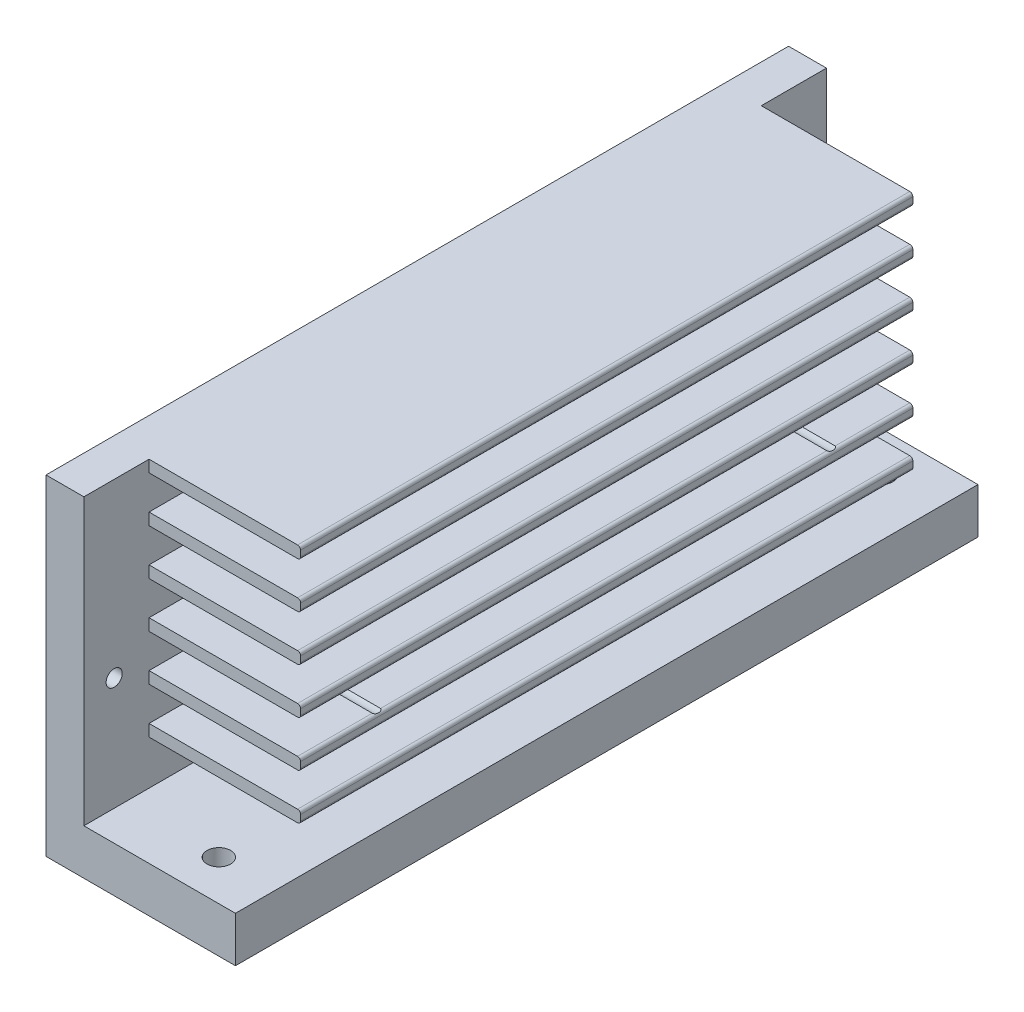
ISO-10303-21;
HEADER;
FILE_DESCRIPTION(('STEP AP214'),'2;1');
FILE_NAME('part.step','',(''),(''),'','','');
FILE_SCHEMA(('AUTOMOTIVE_DESIGN { 1 0 10303 214 1 1 1 1 }'));
ENDSEC;
DATA;
#1=APPLICATION_CONTEXT('core data for automotive mechanical design processes');
#2=APPLICATION_PROTOCOL_DEFINITION('international standard','automotive_design',2000,#1);
#3=PRODUCT_CONTEXT('',#1,'mechanical');
#4=PRODUCT('Part','Part','',(#3));
#5=PRODUCT_RELATED_PRODUCT_CATEGORY('part','',(#4));
#6=PRODUCT_DEFINITION_FORMATION('','',#4);
#7=PRODUCT_DEFINITION_CONTEXT('part definition',#1,'design');
#8=PRODUCT_DEFINITION('design','',#6,#7);
#9=PRODUCT_DEFINITION_SHAPE('','',#8);
#10=(LENGTH_UNIT() NAMED_UNIT(*) SI_UNIT(.MILLI.,.METRE.));
#11=(NAMED_UNIT(*) PLANE_ANGLE_UNIT() SI_UNIT($,.RADIAN.));
#12=(NAMED_UNIT(*) SI_UNIT($,.STERADIAN.) SOLID_ANGLE_UNIT());
#13=UNCERTAINTY_MEASURE_WITH_UNIT(LENGTH_MEASURE(1.E-05),#10,'distance_accuracy_value','');
#14=(GEOMETRIC_REPRESENTATION_CONTEXT(3) GLOBAL_UNCERTAINTY_ASSIGNED_CONTEXT((#13)) GLOBAL_UNIT_ASSIGNED_CONTEXT((#10,
#11,#12)) REPRESENTATION_CONTEXT('',''));
#15=CARTESIAN_POINT('',(0.,0.,0.));
#16=DIRECTION('',(0.,0.,1.));
#17=DIRECTION('',(1.,0.,0.));
#18=AXIS2_PLACEMENT_3D('',#15,#16,#17);
#19=CARTESIAN_POINT('',(6.35,24.6888,-87.7071496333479));
#20=DIRECTION('',(0.,1.,0.));
#21=DIRECTION('',(-1.,0.,0.));
#22=AXIS2_PLACEMENT_3D('',#19,#20,#21);
#23=PLANE('',#22);
#24=DIRECTION('',(-1.,0.,0.));
#25=VECTOR('',#24,1.);
#26=CARTESIAN_POINT('',(0.,24.6888,-38.797922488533));
#27=LINE('',#26,#25);
#28=CARTESIAN_POINT('',(31.242,24.6888,-38.797922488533));
#29=VERTEX_POINT('',#28);
#30=CARTESIAN_POINT('',(6.35,24.6888,-38.797922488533));
#31=VERTEX_POINT('',#30);
#32=EDGE_CURVE('E329',#29,#31,#27,.T.);
#33=ORIENTED_EDGE('',*,*,#32,.F.);
#34=DIRECTION('',(0.,0.,1.));
#35=VECTOR('',#34,1.);
#36=CARTESIAN_POINT('',(31.242,24.6888,-87.7071496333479));
#37=LINE('',#36,#35);
#38=CARTESIAN_POINT('',(31.242,24.6888,-51.308));
#39=VERTEX_POINT('',#38);
#40=EDGE_CURVE('E338',#39,#29,#37,.T.);
#41=ORIENTED_EDGE('',*,*,#40,.F.);
#42=DIRECTION('',(-1.,0.,0.));
#43=VECTOR('',#42,1.);
#44=CARTESIAN_POINT('',(6.35,24.6888,-51.308));
#45=LINE('',#44,#43);
#46=CARTESIAN_POINT('',(6.35,24.6888,-51.308));
#47=VERTEX_POINT('',#46);
#48=EDGE_CURVE('E801',#39,#47,#45,.T.);
#49=ORIENTED_EDGE('',*,*,#48,.T.);
#50=DIRECTION('',(0.,0.,1.));
#51=VECTOR('',#50,1.);
#52=CARTESIAN_POINT('',(6.35,24.6888,-87.7071496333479));
#53=LINE('',#52,#51);
#54=EDGE_CURVE('E340',#47,#31,#53,.T.);
#55=ORIENTED_EDGE('',*,*,#54,.T.);
#56=EDGE_LOOP('',(#33,#41,#49,#55));
#57=FACE_BOUND('',#56,.T.);
#58=ADVANCED_FACE('F32',(#57),#23,.T.);
#59=DIRECTION('',(-1.,0.,0.));
#60=VECTOR('',#59,1.);
#61=CARTESIAN_POINT('',(0.,24.6888,-37.402077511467));
#62=LINE('',#61,#60);
#63=CARTESIAN_POINT('',(6.35,24.6888,-37.402077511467));
#64=VERTEX_POINT('',#63);
#65=CARTESIAN_POINT('',(31.242,24.6888,-37.402077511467));
#66=VERTEX_POINT('',#65);
#67=EDGE_CURVE('E51',#64,#66,#62,.F.);
#68=ORIENTED_EDGE('',*,*,#67,.F.);
#69=CARTESIAN_POINT('',(6.35,24.6888,37.402077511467));
#70=VERTEX_POINT('',#69);
#71=EDGE_CURVE('E58',#64,#70,#53,.T.);
#72=ORIENTED_EDGE('',*,*,#71,.T.);
#73=DIRECTION('',(-1.,0.,0.));
#74=VECTOR('',#73,1.);
#75=CARTESIAN_POINT('',(0.,24.6888,37.402077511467));
#76=LINE('',#75,#74);
#77=CARTESIAN_POINT('',(31.242,24.6888,37.402077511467));
#78=VERTEX_POINT('',#77);
#79=EDGE_CURVE('E497',#78,#70,#76,.T.);
#80=ORIENTED_EDGE('',*,*,#79,.F.);
#81=EDGE_CURVE('E348',#66,#78,#37,.T.);
#82=ORIENTED_EDGE('',*,*,#81,.F.);
#83=EDGE_LOOP('',(#68,#72,#80,#82));
#84=FACE_BOUND('',#83,.T.);
#85=ADVANCED_FACE('F582',(#84),#23,.T.);
#86=CARTESIAN_POINT('',(0.,55.372,62.23));
#87=DIRECTION('',(0.,-1.,0.));
#88=DIRECTION('',(0.,0.,-1.));
#89=AXIS2_PLACEMENT_3D('',#86,#87,#88);
#90=PLANE('',#89);
#91=DIRECTION('',(-1.,0.,0.));
#92=VECTOR('',#91,1.);
#93=CARTESIAN_POINT('',(31.75,55.372,51.308));
#94=LINE('',#93,#92);
#95=CARTESIAN_POINT('',(31.242,55.372,51.308));
#96=VERTEX_POINT('',#95);
#97=CARTESIAN_POINT('',(6.35,55.372,51.308));
#98=VERTEX_POINT('',#97);
#99=EDGE_CURVE('E707',#96,#98,#94,.T.);
#100=ORIENTED_EDGE('',*,*,#99,.F.);
#101=DIRECTION('',(0.,0.,1.));
#102=VECTOR('',#101,1.);
#103=CARTESIAN_POINT('',(31.242,55.372,-87.7071496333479));
#104=LINE('',#103,#102);
#105=CARTESIAN_POINT('',(31.242,55.372,-51.308));
#106=VERTEX_POINT('',#105);
#107=EDGE_CURVE('E428',#106,#96,#104,.T.);
#108=ORIENTED_EDGE('',*,*,#107,.F.);
#109=DIRECTION('',(-1.,0.,0.));
#110=VECTOR('',#109,1.);
#111=CARTESIAN_POINT('',(31.75,55.372,-51.308));
#112=LINE('',#111,#110);
#113=CARTESIAN_POINT('',(6.35,55.372,-51.308));
#114=VERTEX_POINT('',#113);
#115=EDGE_CURVE('E783',#106,#114,#112,.T.);
#116=ORIENTED_EDGE('',*,*,#115,.T.);
#117=DIRECTION('',(0.,0.,1.));
#118=VECTOR('',#117,1.);
#119=CARTESIAN_POINT('',(6.35,55.372,-62.23));
#120=LINE('',#119,#118);
#121=CARTESIAN_POINT('',(6.35,55.372,-62.23));
#122=VERTEX_POINT('',#121);
#123=EDGE_CURVE('E649',#122,#114,#120,.T.);
#124=ORIENTED_EDGE('',*,*,#123,.F.);
#125=DIRECTION('',(-1.,0.,0.));
#126=VECTOR('',#125,1.);
#127=CARTESIAN_POINT('',(0.,55.372,-62.23));
#128=LINE('',#127,#126);
#129=CARTESIAN_POINT('',(0.,55.372,-62.23));
#130=VERTEX_POINT('',#129);
#131=EDGE_CURVE('E453',#122,#130,#128,.T.);
#132=ORIENTED_EDGE('',*,*,#131,.T.);
#133=DIRECTION('',(0.,0.,-1.));
#134=VECTOR('',#133,1.);
#135=CARTESIAN_POINT('',(0.,55.372,62.23));
#136=LINE('',#135,#134);
#137=CARTESIAN_POINT('',(0.,55.372,62.23));
#138=VERTEX_POINT('',#137);
#139=EDGE_CURVE('E473',#138,#130,#136,.T.);
#140=ORIENTED_EDGE('',*,*,#139,.F.);
#141=DIRECTION('',(-1.,0.,0.));
#142=VECTOR('',#141,1.);
#143=CARTESIAN_POINT('',(0.,55.372,62.23));
#144=LINE('',#143,#142);
#145=CARTESIAN_POINT('',(6.35,55.372,62.23));
#146=VERTEX_POINT('',#145);
#147=EDGE_CURVE('E466',#146,#138,#144,.T.);
#148=ORIENTED_EDGE('',*,*,#147,.F.);
#149=DIRECTION('',(0.,0.,1.));
#150=VECTOR('',#149,1.);
#151=CARTESIAN_POINT('',(6.35,55.372,62.23));
#152=LINE('',#151,#150);
#153=EDGE_CURVE('E1345',#98,#146,#152,.T.);
#154=ORIENTED_EDGE('',*,*,#153,.F.);
#155=EDGE_LOOP('',(#100,#108,#116,#124,#132,#140,#148,#154));
#156=FACE_BOUND('',#155,.T.);
#157=ADVANCED_FACE('F593',(#156),#90,.F.);
#158=CARTESIAN_POINT('',(31.242,54.864,-87.7071496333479));
#159=DIRECTION('',(0.,0.,1.));
#160=DIRECTION('',(1.,0.,0.));
#161=AXIS2_PLACEMENT_3D('',#158,#159,#160);
#162=CYLINDRICAL_SURFACE('',#161,0.508000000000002);
#163=ORIENTED_EDGE('',*,*,#107,.T.);
#164=CARTESIAN_POINT('',(31.242,54.864,51.308));
#165=DIRECTION('',(0.,0.,1.));
#166=DIRECTION('',(1.,0.,0.));
#167=AXIS2_PLACEMENT_3D('',#164,#165,#166);
#168=CIRCLE('',#167,0.508000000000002);
#169=CARTESIAN_POINT('',(31.75,54.864,51.308));
#170=VERTEX_POINT('',#169);
#171=EDGE_CURVE('E772',#96,#170,#168,.F.);
#172=ORIENTED_EDGE('',*,*,#171,.T.);
#173=DIRECTION('',(0.,0.,1.));
#174=VECTOR('',#173,1.);
#175=CARTESIAN_POINT('',(31.75,54.864,-87.7071496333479));
#176=LINE('',#175,#174);
#177=CARTESIAN_POINT('',(31.75,54.864,-51.308));
#178=VERTEX_POINT('',#177);
#179=EDGE_CURVE('E432',#178,#170,#176,.T.);
#180=ORIENTED_EDGE('',*,*,#179,.F.);
#181=CARTESIAN_POINT('',(31.242,54.864,-51.308));
#182=DIRECTION('',(0.,0.,-1.));
#183=DIRECTION('',(-1.,0.,0.));
#184=AXIS2_PLACEMENT_3D('',#181,#182,#183);
#185=CIRCLE('',#184,0.508000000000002);
#186=EDGE_CURVE('E845',#178,#106,#185,.F.);
#187=ORIENTED_EDGE('',*,*,#186,.T.);
#188=EDGE_LOOP('',(#163,#172,#180,#187));
#189=FACE_BOUND('',#188,.T.);
#190=ADVANCED_FACE('F597',(#189),#162,.T.);
#191=CARTESIAN_POINT('',(31.75,54.864,-87.7071496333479));
#192=DIRECTION('',(1.,0.,0.));
#193=DIRECTION('',(0.,1.,0.));
#194=AXIS2_PLACEMENT_3D('',#191,#192,#193);
#195=PLANE('',#194);
#196=ORIENTED_EDGE('',*,*,#179,.T.);
#197=DIRECTION('',(0.,1.,0.));
#198=VECTOR('',#197,1.);
#199=CARTESIAN_POINT('',(31.75,7.62,51.308));
#200=LINE('',#199,#198);
#201=CARTESIAN_POINT('',(31.75,53.8988,51.308));
#202=VERTEX_POINT('',#201);
#203=EDGE_CURVE('E1342',#202,#170,#200,.T.);
#204=ORIENTED_EDGE('',*,*,#203,.F.);
#205=DIRECTION('',(0.,0.,1.));
#206=VECTOR('',#205,1.);
#207=CARTESIAN_POINT('',(31.75,53.8988,-87.7071496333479));
#208=LINE('',#207,#206);
#209=CARTESIAN_POINT('',(31.75,53.8988,-51.308));
#210=VERTEX_POINT('',#209);
#211=EDGE_CURVE('E435',#210,#202,#208,.T.);
#212=ORIENTED_EDGE('',*,*,#211,.F.);
#213=DIRECTION('',(0.,-1.,0.));
#214=VECTOR('',#213,1.);
#215=CARTESIAN_POINT('',(31.75,7.62,-51.308));
#216=LINE('',#215,#214);
#217=EDGE_CURVE('E782',#178,#210,#216,.T.);
#218=ORIENTED_EDGE('',*,*,#217,.F.);
#219=EDGE_LOOP('',(#196,#204,#212,#218));
#220=FACE_BOUND('',#219,.T.);
#221=ADVANCED_FACE('F1061',(#220),#195,.T.);
#222=CARTESIAN_POINT('',(31.242,53.8988,-87.7071496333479));
#223=DIRECTION('',(0.,0.,1.));
#224=DIRECTION('',(1.,0.,0.));
#225=AXIS2_PLACEMENT_3D('',#222,#223,#224);
#226=CYLINDRICAL_SURFACE('',#225,0.508000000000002);
#227=ORIENTED_EDGE('',*,*,#211,.T.);
#228=CARTESIAN_POINT('',(31.242,53.8988,51.308));
#229=DIRECTION('',(0.,0.,1.));
#230=DIRECTION('',(1.,0.,0.));
#231=AXIS2_PLACEMENT_3D('',#228,#229,#230);
#232=CIRCLE('',#231,0.508000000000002);
#233=CARTESIAN_POINT('',(31.242,53.3908,51.308));
#234=VERTEX_POINT('',#233);
#235=EDGE_CURVE('E769',#202,#234,#232,.F.);
#236=ORIENTED_EDGE('',*,*,#235,.T.);
#237=DIRECTION('',(0.,0.,1.));
#238=VECTOR('',#237,1.);
#239=CARTESIAN_POINT('',(31.242,53.3908,-87.7071496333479));
#240=LINE('',#239,#238);
#241=CARTESIAN_POINT('',(31.242,53.3908,-51.308));
#242=VERTEX_POINT('',#241);
#243=EDGE_CURVE('E438',#242,#234,#240,.T.);
#244=ORIENTED_EDGE('',*,*,#243,.F.);
#245=CARTESIAN_POINT('',(31.242,53.8988,-51.308));
#246=DIRECTION('',(0.,0.,-1.));
#247=DIRECTION('',(-1.,0.,0.));
#248=AXIS2_PLACEMENT_3D('',#245,#246,#247);
#249=CIRCLE('',#248,0.508000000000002);
#250=EDGE_CURVE('E842',#242,#210,#249,.F.);
#251=ORIENTED_EDGE('',*,*,#250,.T.);
#252=EDGE_LOOP('',(#227,#236,#244,#251));
#253=FACE_BOUND('',#252,.T.);
#254=ADVANCED_FACE('F1071',(#253),#226,.T.);
#255=CARTESIAN_POINT('',(6.35,53.3908,-87.7071496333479));
#256=DIRECTION('',(0.,-1.,0.));
#257=DIRECTION('',(0.,0.,-1.));
#258=AXIS2_PLACEMENT_3D('',#255,#256,#257);
#259=PLANE('',#258);
#260=ORIENTED_EDGE('',*,*,#243,.T.);
#261=DIRECTION('',(-1.,0.,0.));
#262=VECTOR('',#261,1.);
#263=CARTESIAN_POINT('',(6.35,53.3908,51.308));
#264=LINE('',#263,#262);
#265=CARTESIAN_POINT('',(6.35,53.3908,51.308));
#266=VERTEX_POINT('',#265);
#267=EDGE_CURVE('E766',#234,#266,#264,.T.);
#268=ORIENTED_EDGE('',*,*,#267,.T.);
#269=DIRECTION('',(0.,0.,1.));
#270=VECTOR('',#269,1.);
#271=CARTESIAN_POINT('',(6.35,53.3908,-87.7071496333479));
#272=LINE('',#271,#270);
#273=CARTESIAN_POINT('',(6.35,53.3908,-51.308));
#274=VERTEX_POINT('',#273);
#275=EDGE_CURVE('E413',#274,#266,#272,.T.);
#276=ORIENTED_EDGE('',*,*,#275,.F.);
#277=DIRECTION('',(1.,0.,0.));
#278=VECTOR('',#277,1.);
#279=CARTESIAN_POINT('',(6.35,53.3908,-51.308));
#280=LINE('',#279,#278);
#281=EDGE_CURVE('E839',#274,#242,#280,.T.);
#282=ORIENTED_EDGE('',*,*,#281,.T.);
#283=EDGE_LOOP('',(#260,#268,#276,#282));
#284=FACE_BOUND('',#283,.T.);
#285=ADVANCED_FACE('F876',(#284),#259,.T.);
#286=CARTESIAN_POINT('',(6.35,47.7012,-87.7071496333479));
#287=DIRECTION('',(0.,1.,0.));
#288=DIRECTION('',(-1.,0.,0.));
#289=AXIS2_PLACEMENT_3D('',#286,#287,#288);
#290=PLANE('',#289);
#291=DIRECTION('',(0.,0.,1.));
#292=VECTOR('',#291,1.);
#293=CARTESIAN_POINT('',(6.35,47.7012,-87.7071496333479));
#294=LINE('',#293,#292);
#295=CARTESIAN_POINT('',(6.35,47.7012,-51.308));
#296=VERTEX_POINT('',#295);
#297=CARTESIAN_POINT('',(6.35,47.7012,51.308));
#298=VERTEX_POINT('',#297);
#299=EDGE_CURVE('E410',#296,#298,#294,.T.);
#300=ORIENTED_EDGE('',*,*,#299,.T.);
#301=DIRECTION('',(1.,0.,0.));
#302=VECTOR('',#301,1.);
#303=CARTESIAN_POINT('',(6.35,47.7012,51.308));
#304=LINE('',#303,#302);
#305=CARTESIAN_POINT('',(31.242,47.7012,51.308));
#306=VERTEX_POINT('',#305);
#307=EDGE_CURVE('E763',#298,#306,#304,.T.);
#308=ORIENTED_EDGE('',*,*,#307,.T.);
#309=DIRECTION('',(0.,0.,1.));
#310=VECTOR('',#309,1.);
#311=CARTESIAN_POINT('',(31.242,47.7012,-87.7071496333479));
#312=LINE('',#311,#310);
#313=CARTESIAN_POINT('',(31.242,47.7012,-51.308));
#314=VERTEX_POINT('',#313);
#315=EDGE_CURVE('E414',#314,#306,#312,.T.);
#316=ORIENTED_EDGE('',*,*,#315,.F.);
#317=DIRECTION('',(-1.,0.,0.));
#318=VECTOR('',#317,1.);
#319=CARTESIAN_POINT('',(6.35,47.7012,-51.308));
#320=LINE('',#319,#318);
#321=EDGE_CURVE('E836',#314,#296,#320,.T.);
#322=ORIENTED_EDGE('',*,*,#321,.T.);
#323=EDGE_LOOP('',(#300,#308,#316,#322));
#324=FACE_BOUND('',#323,.T.);
#325=ADVANCED_FACE('F1089',(#324),#290,.T.);
#326=CARTESIAN_POINT('',(31.242,47.1932,-87.7071496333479));
#327=DIRECTION('',(0.,0.,1.));
#328=DIRECTION('',(1.,0.,0.));
#329=AXIS2_PLACEMENT_3D('',#326,#327,#328);
#330=CYLINDRICAL_SURFACE('',#329,0.508000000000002);
#331=ORIENTED_EDGE('',*,*,#315,.T.);
#332=CARTESIAN_POINT('',(31.242,47.1932,51.308));
#333=DIRECTION('',(0.,0.,1.));
#334=DIRECTION('',(1.,0.,0.));
#335=AXIS2_PLACEMENT_3D('',#332,#333,#334);
#336=CIRCLE('',#335,0.508000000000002);
#337=CARTESIAN_POINT('',(31.75,47.1932,51.308));
#338=VERTEX_POINT('',#337);
#339=EDGE_CURVE('E760',#306,#338,#336,.F.);
#340=ORIENTED_EDGE('',*,*,#339,.T.);
#341=DIRECTION('',(0.,0.,1.));
#342=VECTOR('',#341,1.);
#343=CARTESIAN_POINT('',(31.75,47.1932,-87.7071496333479));
#344=LINE('',#343,#342);
#345=CARTESIAN_POINT('',(31.75,47.1932,-51.308));
#346=VERTEX_POINT('',#345);
#347=EDGE_CURVE('E417',#346,#338,#344,.T.);
#348=ORIENTED_EDGE('',*,*,#347,.F.);
#349=CARTESIAN_POINT('',(31.242,47.1932,-51.308));
#350=DIRECTION('',(0.,0.,-1.));
#351=DIRECTION('',(-1.,0.,0.));
#352=AXIS2_PLACEMENT_3D('',#349,#350,#351);
#353=CIRCLE('',#352,0.508000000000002);
#354=EDGE_CURVE('E833',#346,#314,#353,.F.);
#355=ORIENTED_EDGE('',*,*,#354,.T.);
#356=EDGE_LOOP('',(#331,#340,#348,#355));
#357=FACE_BOUND('',#356,.T.);
#358=ADVANCED_FACE('F1098',(#357),#330,.T.);
#359=CARTESIAN_POINT('',(31.75,47.1932,-87.7071496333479));
#360=DIRECTION('',(1.,0.,0.));
#361=DIRECTION('',(0.,1.,0.));
#362=AXIS2_PLACEMENT_3D('',#359,#360,#361);
#363=PLANE('',#362);
#364=ORIENTED_EDGE('',*,*,#347,.T.);
#365=CARTESIAN_POINT('',(31.75,46.228,51.308));
#366=VERTEX_POINT('',#365);
#367=EDGE_CURVE('E1344',#366,#338,#200,.T.);
#368=ORIENTED_EDGE('',*,*,#367,.F.);
#369=DIRECTION('',(0.,0.,1.));
#370=VECTOR('',#369,1.);
#371=CARTESIAN_POINT('',(31.75,46.228,-87.7071496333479));
#372=LINE('',#371,#370);
#373=CARTESIAN_POINT('',(31.75,46.228,-51.308));
#374=VERTEX_POINT('',#373);
#375=EDGE_CURVE('E420',#374,#366,#372,.T.);
#376=ORIENTED_EDGE('',*,*,#375,.F.);
#377=EDGE_CURVE('E1369',#346,#374,#216,.T.);
#378=ORIENTED_EDGE('',*,*,#377,.F.);
#379=EDGE_LOOP('',(#364,#368,#376,#378));
#380=FACE_BOUND('',#379,.T.);
#381=ADVANCED_FACE('F1108',(#380),#363,.T.);
#382=CARTESIAN_POINT('',(31.242,46.228,-87.7071496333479));
#383=DIRECTION('',(0.,0.,1.));
#384=DIRECTION('',(1.,0.,0.));
#385=AXIS2_PLACEMENT_3D('',#382,#383,#384);
#386=CYLINDRICAL_SURFACE('',#385,0.508000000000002);
#387=ORIENTED_EDGE('',*,*,#375,.T.);
#388=CARTESIAN_POINT('',(31.242,46.228,51.308));
#389=DIRECTION('',(0.,0.,1.));
#390=DIRECTION('',(1.,0.,0.));
#391=AXIS2_PLACEMENT_3D('',#388,#389,#390);
#392=CIRCLE('',#391,0.508000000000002);
#393=CARTESIAN_POINT('',(31.242,45.72,51.308));
#394=VERTEX_POINT('',#393);
#395=EDGE_CURVE('E757',#366,#394,#392,.F.);
#396=ORIENTED_EDGE('',*,*,#395,.T.);
#397=DIRECTION('',(0.,0.,1.));
#398=VECTOR('',#397,1.);
#399=CARTESIAN_POINT('',(31.242,45.72,-87.7071496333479));
#400=LINE('',#399,#398);
#401=CARTESIAN_POINT('',(31.242,45.72,-51.308));
#402=VERTEX_POINT('',#401);
#403=EDGE_CURVE('E423',#402,#394,#400,.T.);
#404=ORIENTED_EDGE('',*,*,#403,.F.);
#405=CARTESIAN_POINT('',(31.242,46.228,-51.308));
#406=DIRECTION('',(0.,0.,-1.));
#407=DIRECTION('',(-1.,0.,0.));
#408=AXIS2_PLACEMENT_3D('',#405,#406,#407);
#409=CIRCLE('',#408,0.508000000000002);
#410=EDGE_CURVE('E830',#402,#374,#409,.F.);
#411=ORIENTED_EDGE('',*,*,#410,.T.);
#412=EDGE_LOOP('',(#387,#396,#404,#411));
#413=FACE_BOUND('',#412,.T.);
#414=ADVANCED_FACE('F1118',(#413),#386,.T.);
#415=CARTESIAN_POINT('',(6.35,45.72,-87.7071496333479));
#416=DIRECTION('',(0.,-1.,0.));
#417=DIRECTION('',(0.,0.,-1.));
#418=AXIS2_PLACEMENT_3D('',#415,#416,#417);
#419=PLANE('',#418);
#420=ORIENTED_EDGE('',*,*,#403,.T.);
#421=DIRECTION('',(-1.,0.,0.));
#422=VECTOR('',#421,1.);
#423=CARTESIAN_POINT('',(6.35,45.72,51.308));
#424=LINE('',#423,#422);
#425=CARTESIAN_POINT('',(6.35,45.72,51.308));
#426=VERTEX_POINT('',#425);
#427=EDGE_CURVE('E754',#394,#426,#424,.T.);
#428=ORIENTED_EDGE('',*,*,#427,.T.);
#429=DIRECTION('',(0.,0.,1.));
#430=VECTOR('',#429,1.);
#431=CARTESIAN_POINT('',(6.35,45.72,-87.7071496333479));
#432=LINE('',#431,#430);
#433=CARTESIAN_POINT('',(6.35,45.72,-51.308));
#434=VERTEX_POINT('',#433);
#435=EDGE_CURVE('E395',#434,#426,#432,.T.);
#436=ORIENTED_EDGE('',*,*,#435,.F.);
#437=DIRECTION('',(1.,0.,0.));
#438=VECTOR('',#437,1.);
#439=CARTESIAN_POINT('',(6.35,45.72,-51.308));
#440=LINE('',#439,#438);
#441=EDGE_CURVE('E827',#434,#402,#440,.T.);
#442=ORIENTED_EDGE('',*,*,#441,.T.);
#443=EDGE_LOOP('',(#420,#428,#436,#442));
#444=FACE_BOUND('',#443,.T.);
#445=ADVANCED_FACE('F1128',(#444),#419,.T.);
#446=CARTESIAN_POINT('',(6.35,40.0304,-87.7071496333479));
#447=DIRECTION('',(0.,1.,0.));
#448=DIRECTION('',(-1.,0.,0.));
#449=AXIS2_PLACEMENT_3D('',#446,#447,#448);
#450=PLANE('',#449);
#451=DIRECTION('',(0.,0.,1.));
#452=VECTOR('',#451,1.);
#453=CARTESIAN_POINT('',(6.35,40.0304,-87.7071496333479));
#454=LINE('',#453,#452);
#455=CARTESIAN_POINT('',(6.35,40.0304,-51.308));
#456=VERTEX_POINT('',#455);
#457=CARTESIAN_POINT('',(6.35,40.0304,51.308));
#458=VERTEX_POINT('',#457);
#459=EDGE_CURVE('E392',#456,#458,#454,.T.);
#460=ORIENTED_EDGE('',*,*,#459,.T.);
#461=DIRECTION('',(1.,0.,0.));
#462=VECTOR('',#461,1.);
#463=CARTESIAN_POINT('',(6.35,40.0304,51.308));
#464=LINE('',#463,#462);
#465=CARTESIAN_POINT('',(31.242,40.0304,51.308));
#466=VERTEX_POINT('',#465);
#467=EDGE_CURVE('E751',#458,#466,#464,.T.);
#468=ORIENTED_EDGE('',*,*,#467,.T.);
#469=DIRECTION('',(0.,0.,1.));
#470=VECTOR('',#469,1.);
#471=CARTESIAN_POINT('',(31.242,40.0304,-87.7071496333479));
#472=LINE('',#471,#470);
#473=CARTESIAN_POINT('',(31.242,40.0304,-51.308));
#474=VERTEX_POINT('',#473);
#475=EDGE_CURVE('E396',#474,#466,#472,.T.);
#476=ORIENTED_EDGE('',*,*,#475,.F.);
#477=DIRECTION('',(-1.,0.,0.));
#478=VECTOR('',#477,1.);
#479=CARTESIAN_POINT('',(6.35,40.0304,-51.308));
#480=LINE('',#479,#478);
#481=EDGE_CURVE('E824',#474,#456,#480,.T.);
#482=ORIENTED_EDGE('',*,*,#481,.T.);
#483=EDGE_LOOP('',(#460,#468,#476,#482));
#484=FACE_BOUND('',#483,.T.);
#485=ADVANCED_FACE('F1138',(#484),#450,.T.);
#486=CARTESIAN_POINT('',(31.242,39.5224,-87.7071496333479));
#487=DIRECTION('',(0.,0.,1.));
#488=DIRECTION('',(1.,0.,0.));
#489=AXIS2_PLACEMENT_3D('',#486,#487,#488);
#490=CYLINDRICAL_SURFACE('',#489,0.508000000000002);
#491=ORIENTED_EDGE('',*,*,#475,.T.);
#492=CARTESIAN_POINT('',(31.242,39.5224,51.308));
#493=DIRECTION('',(0.,0.,1.));
#494=DIRECTION('',(1.,0.,0.));
#495=AXIS2_PLACEMENT_3D('',#492,#493,#494);
#496=CIRCLE('',#495,0.508000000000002);
#497=CARTESIAN_POINT('',(31.75,39.5224,51.308));
#498=VERTEX_POINT('',#497);
#499=EDGE_CURVE('E748',#466,#498,#496,.F.);
#500=ORIENTED_EDGE('',*,*,#499,.T.);
#501=DIRECTION('',(0.,0.,1.));
#502=VECTOR('',#501,1.);
#503=CARTESIAN_POINT('',(31.75,39.5224,-87.7071496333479));
#504=LINE('',#503,#502);
#505=CARTESIAN_POINT('',(31.75,39.5224,-51.308));
#506=VERTEX_POINT('',#505);
#507=EDGE_CURVE('E399',#506,#498,#504,.T.);
#508=ORIENTED_EDGE('',*,*,#507,.F.);
#509=CARTESIAN_POINT('',(31.242,39.5224,-51.308));
#510=DIRECTION('',(0.,0.,-1.));
#511=DIRECTION('',(-1.,0.,0.));
#512=AXIS2_PLACEMENT_3D('',#509,#510,#511);
#513=CIRCLE('',#512,0.508000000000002);
#514=EDGE_CURVE('E821',#506,#474,#513,.F.);
#515=ORIENTED_EDGE('',*,*,#514,.T.);
#516=EDGE_LOOP('',(#491,#500,#508,#515));
#517=FACE_BOUND('',#516,.T.);
#518=ADVANCED_FACE('F1148',(#517),#490,.T.);
#519=CARTESIAN_POINT('',(31.75,39.5224,-87.7071496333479));
#520=DIRECTION('',(1.,0.,0.));
#521=DIRECTION('',(0.,1.,0.));
#522=AXIS2_PLACEMENT_3D('',#519,#520,#521);
#523=PLANE('',#522);
#524=ORIENTED_EDGE('',*,*,#507,.T.);
#525=CARTESIAN_POINT('',(31.75,38.5572,51.308));
#526=VERTEX_POINT('',#525);
#527=EDGE_CURVE('E1343',#526,#498,#200,.T.);
#528=ORIENTED_EDGE('',*,*,#527,.F.);
#529=DIRECTION('',(0.,0.,1.));
#530=VECTOR('',#529,1.);
#531=CARTESIAN_POINT('',(31.75,38.5572,-87.7071496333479));
#532=LINE('',#531,#530);
#533=CARTESIAN_POINT('',(31.75,38.5572,-51.308));
#534=VERTEX_POINT('',#533);
#535=EDGE_CURVE('E402',#534,#526,#532,.T.);
#536=ORIENTED_EDGE('',*,*,#535,.F.);
#537=EDGE_CURVE('E1368',#506,#534,#216,.T.);
#538=ORIENTED_EDGE('',*,*,#537,.F.);
#539=EDGE_LOOP('',(#524,#528,#536,#538));
#540=FACE_BOUND('',#539,.T.);
#541=ADVANCED_FACE('F1158',(#540),#523,.T.);
#542=CARTESIAN_POINT('',(31.242,38.5572,-87.7071496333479));
#543=DIRECTION('',(0.,0.,1.));
#544=DIRECTION('',(1.,0.,0.));
#545=AXIS2_PLACEMENT_3D('',#542,#543,#544);
#546=CYLINDRICAL_SURFACE('',#545,0.508000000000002);
#547=ORIENTED_EDGE('',*,*,#535,.T.);
#548=CARTESIAN_POINT('',(31.242,38.5572,51.308));
#549=DIRECTION('',(0.,0.,1.));
#550=DIRECTION('',(1.,0.,0.));
#551=AXIS2_PLACEMENT_3D('',#548,#549,#550);
#552=CIRCLE('',#551,0.508000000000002);
#553=CARTESIAN_POINT('',(31.242,38.0492,51.308));
#554=VERTEX_POINT('',#553);
#555=EDGE_CURVE('E745',#526,#554,#552,.F.);
#556=ORIENTED_EDGE('',*,*,#555,.T.);
#557=DIRECTION('',(0.,0.,1.));
#558=VECTOR('',#557,1.);
#559=CARTESIAN_POINT('',(31.242,38.0492,-87.7071496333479));
#560=LINE('',#559,#558);
#561=CARTESIAN_POINT('',(31.242,38.0492,-51.308));
#562=VERTEX_POINT('',#561);
#563=EDGE_CURVE('E405',#562,#554,#560,.T.);
#564=ORIENTED_EDGE('',*,*,#563,.F.);
#565=CARTESIAN_POINT('',(31.242,38.5572,-51.308));
#566=DIRECTION('',(0.,0.,-1.));
#567=DIRECTION('',(-1.,0.,0.));
#568=AXIS2_PLACEMENT_3D('',#565,#566,#567);
#569=CIRCLE('',#568,0.508000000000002);
#570=EDGE_CURVE('E818',#562,#534,#569,.F.);
#571=ORIENTED_EDGE('',*,*,#570,.T.);
#572=EDGE_LOOP('',(#547,#556,#564,#571));
#573=FACE_BOUND('',#572,.T.);
#574=ADVANCED_FACE('F1168',(#573),#546,.T.);
#575=CARTESIAN_POINT('',(6.35,38.0492,-87.7071496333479));
#576=DIRECTION('',(0.,-1.,0.));
#577=DIRECTION('',(0.,0.,-1.));
#578=AXIS2_PLACEMENT_3D('',#575,#576,#577);
#579=PLANE('',#578);
#580=ORIENTED_EDGE('',*,*,#563,.T.);
#581=DIRECTION('',(-1.,0.,0.));
#582=VECTOR('',#581,1.);
#583=CARTESIAN_POINT('',(6.35,38.0492,51.308));
#584=LINE('',#583,#582);
#585=CARTESIAN_POINT('',(6.35,38.0492,51.308));
#586=VERTEX_POINT('',#585);
#587=EDGE_CURVE('E742',#554,#586,#584,.T.);
#588=ORIENTED_EDGE('',*,*,#587,.T.);
#589=DIRECTION('',(0.,0.,1.));
#590=VECTOR('',#589,1.);
#591=CARTESIAN_POINT('',(6.35,38.0492,-87.7071496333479));
#592=LINE('',#591,#590);
#593=CARTESIAN_POINT('',(6.35,38.0492,-51.308));
#594=VERTEX_POINT('',#593);
#595=EDGE_CURVE('E376',#594,#586,#592,.T.);
#596=ORIENTED_EDGE('',*,*,#595,.F.);
#597=DIRECTION('',(1.,0.,0.));
#598=VECTOR('',#597,1.);
#599=CARTESIAN_POINT('',(6.35,38.0492,-51.308));
#600=LINE('',#599,#598);
#601=EDGE_CURVE('E815',#594,#562,#600,.T.);
#602=ORIENTED_EDGE('',*,*,#601,.T.);
#603=EDGE_LOOP('',(#580,#588,#596,#602));
#604=FACE_BOUND('',#603,.T.);
#605=ADVANCED_FACE('F1178',(#604),#579,.T.);
#606=CARTESIAN_POINT('',(6.35,32.3596,-87.7071496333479));
#607=DIRECTION('',(0.,1.,0.));
#608=DIRECTION('',(-1.,0.,0.));
#609=AXIS2_PLACEMENT_3D('',#606,#607,#608);
#610=PLANE('',#609);
#611=DIRECTION('',(0.,0.,1.));
#612=VECTOR('',#611,1.);
#613=CARTESIAN_POINT('',(6.35,32.3596,-87.7071496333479));
#614=LINE('',#613,#612);
#615=CARTESIAN_POINT('',(6.35,32.3596,-51.308));
#616=VERTEX_POINT('',#615);
#617=CARTESIAN_POINT('',(6.35,32.3596,51.308));
#618=VERTEX_POINT('',#617);
#619=EDGE_CURVE('E373',#616,#618,#614,.T.);
#620=ORIENTED_EDGE('',*,*,#619,.T.);
#621=DIRECTION('',(1.,0.,0.));
#622=VECTOR('',#621,1.);
#623=CARTESIAN_POINT('',(6.35,32.3596,51.308));
#624=LINE('',#623,#622);
#625=CARTESIAN_POINT('',(31.242,32.3596,51.308));
#626=VERTEX_POINT('',#625);
#627=EDGE_CURVE('E739',#618,#626,#624,.T.);
#628=ORIENTED_EDGE('',*,*,#627,.T.);
#629=DIRECTION('',(0.,0.,1.));
#630=VECTOR('',#629,1.);
#631=CARTESIAN_POINT('',(31.242,32.3596,-87.7071496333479));
#632=LINE('',#631,#630);
#633=CARTESIAN_POINT('',(31.242,32.3596,-51.308));
#634=VERTEX_POINT('',#633);
#635=EDGE_CURVE('E377',#634,#626,#632,.T.);
#636=ORIENTED_EDGE('',*,*,#635,.F.);
#637=DIRECTION('',(-1.,0.,0.));
#638=VECTOR('',#637,1.);
#639=CARTESIAN_POINT('',(6.35,32.3596,-51.308));
#640=LINE('',#639,#638);
#641=EDGE_CURVE('E812',#634,#616,#640,.T.);
#642=ORIENTED_EDGE('',*,*,#641,.T.);
#643=EDGE_LOOP('',(#620,#628,#636,#642));
#644=FACE_BOUND('',#643,.T.);
#645=ADVANCED_FACE('F1188',(#644),#610,.T.);
#646=CARTESIAN_POINT('',(31.242,31.8516,-87.7071496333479));
#647=DIRECTION('',(0.,0.,1.));
#648=DIRECTION('',(1.,0.,0.));
#649=AXIS2_PLACEMENT_3D('',#646,#647,#648);
#650=CYLINDRICAL_SURFACE('',#649,0.508000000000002);
#651=ORIENTED_EDGE('',*,*,#635,.T.);
#652=CARTESIAN_POINT('',(31.242,31.8516,51.308));
#653=DIRECTION('',(0.,0.,1.));
#654=DIRECTION('',(1.,0.,0.));
#655=AXIS2_PLACEMENT_3D('',#652,#653,#654);
#656=CIRCLE('',#655,0.508000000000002);
#657=CARTESIAN_POINT('',(31.75,31.8516,51.308));
#658=VERTEX_POINT('',#657);
#659=EDGE_CURVE('E736',#626,#658,#656,.F.);
#660=ORIENTED_EDGE('',*,*,#659,.T.);
#661=DIRECTION('',(0.,0.,1.));
#662=VECTOR('',#661,1.);
#663=CARTESIAN_POINT('',(31.75,31.8516,-87.7071496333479));
#664=LINE('',#663,#662);
#665=CARTESIAN_POINT('',(31.75,31.8516,-51.308));
#666=VERTEX_POINT('',#665);
#667=EDGE_CURVE('E380',#666,#658,#664,.T.);
#668=ORIENTED_EDGE('',*,*,#667,.F.);
#669=CARTESIAN_POINT('',(31.242,31.8516,-51.308));
#670=DIRECTION('',(0.,0.,-1.));
#671=DIRECTION('',(-1.,0.,0.));
#672=AXIS2_PLACEMENT_3D('',#669,#670,#671);
#673=CIRCLE('',#672,0.508000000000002);
#674=EDGE_CURVE('E809',#666,#634,#673,.F.);
#675=ORIENTED_EDGE('',*,*,#674,.T.);
#676=EDGE_LOOP('',(#651,#660,#668,#675));
#677=FACE_BOUND('',#676,.T.);
#678=ADVANCED_FACE('F1198',(#677),#650,.T.);
#679=CARTESIAN_POINT('',(31.75,31.8516,-87.7071496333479));
#680=DIRECTION('',(1.,0.,0.));
#681=DIRECTION('',(0.,1.,0.));
#682=AXIS2_PLACEMENT_3D('',#679,#680,#681);
#683=PLANE('',#682);
#684=ORIENTED_EDGE('',*,*,#667,.T.);
#685=CARTESIAN_POINT('',(31.75,30.8864,51.308));
#686=VERTEX_POINT('',#685);
#687=EDGE_CURVE('E1341',#686,#658,#200,.T.);
#688=ORIENTED_EDGE('',*,*,#687,.F.);
#689=DIRECTION('',(0.,0.,1.));
#690=VECTOR('',#689,1.);
#691=CARTESIAN_POINT('',(31.75,30.8864,-87.7071496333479));
#692=LINE('',#691,#690);
#693=CARTESIAN_POINT('',(31.75,30.8864,-51.308));
#694=VERTEX_POINT('',#693);
#695=EDGE_CURVE('E383',#694,#686,#692,.T.);
#696=ORIENTED_EDGE('',*,*,#695,.F.);
#697=EDGE_CURVE('E1367',#666,#694,#216,.T.);
#698=ORIENTED_EDGE('',*,*,#697,.F.);
#699=EDGE_LOOP('',(#684,#688,#696,#698));
#700=FACE_BOUND('',#699,.T.);
#701=ADVANCED_FACE('F1208',(#700),#683,.T.);
#702=CARTESIAN_POINT('',(31.242,30.8864,-87.7071496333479));
#703=DIRECTION('',(0.,0.,1.));
#704=DIRECTION('',(1.,0.,0.));
#705=AXIS2_PLACEMENT_3D('',#702,#703,#704);
#706=CYLINDRICAL_SURFACE('',#705,0.508000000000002);
#707=ORIENTED_EDGE('',*,*,#695,.T.);
#708=CARTESIAN_POINT('',(31.242,30.8864,51.308));
#709=DIRECTION('',(0.,0.,1.));
#710=DIRECTION('',(1.,0.,0.));
#711=AXIS2_PLACEMENT_3D('',#708,#709,#710);
#712=CIRCLE('',#711,0.508000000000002);
#713=CARTESIAN_POINT('',(31.242,30.3784,51.308));
#714=VERTEX_POINT('',#713);
#715=EDGE_CURVE('E733',#686,#714,#712,.F.);
#716=ORIENTED_EDGE('',*,*,#715,.T.);
#717=DIRECTION('',(0.,0.,1.));
#718=VECTOR('',#717,1.);
#719=CARTESIAN_POINT('',(31.242,30.3784,-87.7071496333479));
#720=LINE('',#719,#718);
#721=CARTESIAN_POINT('',(31.242,30.3784,-51.308));
#722=VERTEX_POINT('',#721);
#723=EDGE_CURVE('E386',#722,#714,#720,.T.);
#724=ORIENTED_EDGE('',*,*,#723,.F.);
#725=CARTESIAN_POINT('',(31.242,30.8864,-51.308));
#726=DIRECTION('',(0.,0.,-1.));
#727=DIRECTION('',(-1.,0.,0.));
#728=AXIS2_PLACEMENT_3D('',#725,#726,#727);
#729=CIRCLE('',#728,0.508000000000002);
#730=EDGE_CURVE('E806',#722,#694,#729,.F.);
#731=ORIENTED_EDGE('',*,*,#730,.T.);
#732=EDGE_LOOP('',(#707,#716,#724,#731));
#733=FACE_BOUND('',#732,.T.);
#734=ADVANCED_FACE('F588',(#733),#706,.T.);
#735=CARTESIAN_POINT('',(6.35,30.3784,-87.7071496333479));
#736=DIRECTION('',(0.,-1.,0.));
#737=DIRECTION('',(0.,0.,-1.));
#738=AXIS2_PLACEMENT_3D('',#735,#736,#737);
#739=PLANE('',#738);
#740=ORIENTED_EDGE('',*,*,#723,.T.);
#741=DIRECTION('',(-1.,0.,0.));
#742=VECTOR('',#741,1.);
#743=CARTESIAN_POINT('',(6.35,30.3784,51.308));
#744=LINE('',#743,#742);
#745=CARTESIAN_POINT('',(6.35,30.3784,51.308));
#746=VERTEX_POINT('',#745);
#747=EDGE_CURVE('E730',#714,#746,#744,.T.);
#748=ORIENTED_EDGE('',*,*,#747,.T.);
#749=DIRECTION('',(0.,0.,1.));
#750=VECTOR('',#749,1.);
#751=CARTESIAN_POINT('',(6.35,30.3784,-87.7071496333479));
#752=LINE('',#751,#750);
#753=CARTESIAN_POINT('',(6.35,30.3784,-51.308));
#754=VERTEX_POINT('',#753);
#755=EDGE_CURVE('E389',#754,#746,#752,.T.);
#756=ORIENTED_EDGE('',*,*,#755,.F.);
#757=DIRECTION('',(1.,0.,0.));
#758=VECTOR('',#757,1.);
#759=CARTESIAN_POINT('',(6.35,30.3784,-51.308));
#760=LINE('',#759,#758);
#761=EDGE_CURVE('E803',#754,#722,#760,.T.);
#762=ORIENTED_EDGE('',*,*,#761,.T.);
#763=EDGE_LOOP('',(#740,#748,#756,#762));
#764=FACE_BOUND('',#763,.T.);
#765=ADVANCED_FACE('F581',(#764),#739,.T.);
#766=DIRECTION('',(-1.,0.,0.));
#767=VECTOR('',#766,1.);
#768=CARTESIAN_POINT('',(0.,24.6888,38.797922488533));
#769=LINE('',#768,#767);
#770=CARTESIAN_POINT('',(6.35,24.6888,38.797922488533));
#771=VERTEX_POINT('',#770);
#772=CARTESIAN_POINT('',(31.242,24.6888,38.797922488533));
#773=VERTEX_POINT('',#772);
#774=EDGE_CURVE('E496',#771,#773,#769,.F.);
#775=ORIENTED_EDGE('',*,*,#774,.F.);
#776=CARTESIAN_POINT('',(6.35,24.6888,51.308));
#777=VERTEX_POINT('',#776);
#778=EDGE_CURVE('E347',#771,#777,#53,.T.);
#779=ORIENTED_EDGE('',*,*,#778,.T.);
#780=DIRECTION('',(1.,0.,0.));
#781=VECTOR('',#780,1.);
#782=CARTESIAN_POINT('',(6.35,24.6888,51.308));
#783=LINE('',#782,#781);
#784=CARTESIAN_POINT('',(31.242,24.6888,51.308));
#785=VERTEX_POINT('',#784);
#786=EDGE_CURVE('E728',#777,#785,#783,.T.);
#787=ORIENTED_EDGE('',*,*,#786,.T.);
#788=EDGE_CURVE('E350',#773,#785,#37,.T.);
#789=ORIENTED_EDGE('',*,*,#788,.F.);
#790=EDGE_LOOP('',(#775,#779,#787,#789));
#791=FACE_BOUND('',#790,.T.);
#792=ADVANCED_FACE('F499',(#791),#23,.T.);
#793=CARTESIAN_POINT('',(31.242,24.1808,-87.7071496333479));
#794=DIRECTION('',(0.,0.,1.));
#795=DIRECTION('',(1.,0.,0.));
#796=AXIS2_PLACEMENT_3D('',#793,#794,#795);
#797=CYLINDRICAL_SURFACE('',#796,0.508000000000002);
#798=CARTESIAN_POINT('',(31.242,24.6888,-37.402077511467));
#799=CARTESIAN_POINT('',(31.2529566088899,24.6888118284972,-37.402053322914));
#800=CARTESIAN_POINT('',(31.2638838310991,24.6884460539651,-37.4030175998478));
#801=CARTESIAN_POINT('',(31.2852963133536,24.6870610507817,-37.4067104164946));
#802=CARTESIAN_POINT('',(31.295784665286,24.6860477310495,-37.409423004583));
#803=CARTESIAN_POINT('',(31.3161129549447,24.683470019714,-37.416395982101));
#804=CARTESIAN_POINT('',(31.3259547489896,24.6819072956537,-37.4206516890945));
#805=CARTESIAN_POINT('',(31.3449110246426,24.6783604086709,-37.4304477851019));
#806=CARTESIAN_POINT('',(31.3540237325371,24.67637525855,-37.4359911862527));
#807=CARTESIAN_POINT('',(31.3769599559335,24.6707639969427,-37.4519305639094));
#808=CARTESIAN_POINT('',(31.3901284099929,24.6668927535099,-37.463181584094));
#809=CARTESIAN_POINT('',(31.4144756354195,24.6587969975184,-37.4875463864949));
#810=CARTESIAN_POINT('',(31.4256489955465,24.654571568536,-37.5006650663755));
#811=CARTESIAN_POINT('',(31.4534113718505,24.6431084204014,-37.5377238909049));
#812=CARTESIAN_POINT('',(31.4683754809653,24.6358158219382,-37.5628543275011));
#813=CARTESIAN_POINT('',(31.4945000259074,24.6218501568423,-37.6151513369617));
#814=CARTESIAN_POINT('',(31.5056509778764,24.6151786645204,-37.6423227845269));
#815=CARTESIAN_POINT('',(31.5241769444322,24.6033513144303,-37.6955314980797));
#816=CARTESIAN_POINT('',(31.5317923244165,24.5981148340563,-37.7214688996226));
#817=CARTESIAN_POINT('',(31.5450099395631,24.5886163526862,-37.7740337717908));
#818=CARTESIAN_POINT('',(31.550610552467,24.5843551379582,-37.8006617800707));
#819=CARTESIAN_POINT('',(31.5649043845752,24.5731646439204,-37.8812786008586));
#820=CARTESIAN_POINT('',(31.5710740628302,24.5678397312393,-37.9359505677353));
#821=CARTESIAN_POINT('',(31.5783512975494,24.5615262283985,-38.0503142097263));
#822=CARTESIAN_POINT('',(31.5790053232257,24.560926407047,-38.1100518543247));
#823=CARTESIAN_POINT('',(31.5742364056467,24.5651155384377,-38.2290381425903));
#824=CARTESIAN_POINT('',(31.5688248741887,24.5698943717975,-38.2882874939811));
#825=CARTESIAN_POINT('',(31.5540252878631,24.5817387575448,-38.382736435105));
#826=CARTESIAN_POINT('',(31.5469366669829,24.5872402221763,-38.4185013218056));
#827=CARTESIAN_POINT('',(31.5291455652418,24.6000077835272,-38.4888505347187));
#828=CARTESIAN_POINT('',(31.5184435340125,24.6072736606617,-38.5234350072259));
#829=CARTESIAN_POINT('',(31.4957178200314,24.621045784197,-38.5815485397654));
#830=CARTESIAN_POINT('',(31.4847964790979,24.6272428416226,-38.6055780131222));
#831=CARTESIAN_POINT('',(31.4596534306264,24.6400292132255,-38.6517443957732));
#832=CARTESIAN_POINT('',(31.4454405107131,24.6466174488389,-38.6738861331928));
#833=CARTESIAN_POINT('',(31.4198492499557,24.6567538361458,-38.7061204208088));
#834=CARTESIAN_POINT('',(31.4098812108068,24.6603907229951,-38.7172992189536));
#835=CARTESIAN_POINT('',(31.3884119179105,24.66737480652,-38.7382036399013));
#836=CARTESIAN_POINT('',(31.3769119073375,24.6707222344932,-38.7479304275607));
#837=CARTESIAN_POINT('',(31.3547969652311,24.6762218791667,-38.763587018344));
#838=CARTESIAN_POINT('',(31.3444728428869,24.6784789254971,-38.7698869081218));
#839=CARTESIAN_POINT('',(31.3228906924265,24.6824377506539,-38.7808047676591));
#840=CARTESIAN_POINT('',(31.3116356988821,24.6841412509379,-38.7854279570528));
#841=CARTESIAN_POINT('',(31.2907093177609,24.6865455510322,-38.7919107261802));
#842=CARTESIAN_POINT('',(31.2811673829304,24.6873783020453,-38.7941368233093));
#843=CARTESIAN_POINT('',(31.2617583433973,24.6885114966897,-38.7971561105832));
#844=CARTESIAN_POINT('',(31.251889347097,24.6888079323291,-38.797938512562));
#845=CARTESIAN_POINT('',(31.242,24.6888,-38.797922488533));
#846=B_SPLINE_CURVE_WITH_KNOTS('',3,(#798,#799,#800,#801,#802,#803,#804,#805,#806,#807,#808,
#809,#810,#811,#812,#813,#814,#815,#816,#817,#818,#819,#820,#821,#822,#823,#824,#825,#826,#827,
#828,#829,#830,#831,#832,#833,#834,#835,#836,#837,#838,#839,#840,#841,#842,#843,#844,#845),
.UNSPECIFIED.,.F.,.F.,(4,2,2,2,2,2,2,2,2,2,2,2,2,2,2,2,2,2,2,2,2,2,2,4),(0.,0.0327747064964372,
0.0652545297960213,0.0976366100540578,0.130095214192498,0.183031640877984,0.236109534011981,
0.326033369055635,0.416179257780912,0.498663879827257,0.581214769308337,0.746474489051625,
0.92520253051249,1.10359487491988,1.21404539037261,1.32448216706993,1.40564445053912,
1.48659250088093,1.53272252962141,1.5788153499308,1.61559314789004,1.65225545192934,
1.68163614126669,1.71123550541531),.UNSPECIFIED.);
#847=EDGE_CURVE('E11',#66,#29,#846,.T.);
#848=ORIENTED_EDGE('',*,*,#847,.F.);
#849=ORIENTED_EDGE('',*,*,#81,.T.);
#850=CARTESIAN_POINT('',(31.242,24.6888,38.797922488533));
#851=CARTESIAN_POINT('',(31.2529566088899,24.6888118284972,38.797946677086));
#852=CARTESIAN_POINT('',(31.2638838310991,24.6884460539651,38.7969824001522));
#853=CARTESIAN_POINT('',(31.2852963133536,24.6870610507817,38.7932895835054));
#854=CARTESIAN_POINT('',(31.295784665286,24.6860477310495,38.790576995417));
#855=CARTESIAN_POINT('',(31.3161129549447,24.683470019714,38.783604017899));
#856=CARTESIAN_POINT('',(31.3259547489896,24.6819072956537,38.7793483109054));
#857=CARTESIAN_POINT('',(31.3449110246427,24.6783604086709,38.769552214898));
#858=CARTESIAN_POINT('',(31.3540237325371,24.67637525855,38.7640088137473));
#859=CARTESIAN_POINT('',(31.3769599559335,24.6707639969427,38.7480694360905));
#860=CARTESIAN_POINT('',(31.390128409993,24.6668927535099,38.7368184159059));
#861=CARTESIAN_POINT('',(31.4144756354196,24.6587969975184,38.7124536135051));
#862=CARTESIAN_POINT('',(31.4256489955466,24.654571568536,38.6993349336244));
#863=CARTESIAN_POINT('',(31.4534113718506,24.6431084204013,38.662276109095));
#864=CARTESIAN_POINT('',(31.4683754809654,24.6358158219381,38.6371456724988));
#865=CARTESIAN_POINT('',(31.4945000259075,24.6218501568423,38.5848486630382));
#866=CARTESIAN_POINT('',(31.5056509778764,24.6151786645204,38.5576772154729));
#867=CARTESIAN_POINT('',(31.5241769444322,24.6033513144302,38.5044685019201));
#868=CARTESIAN_POINT('',(31.5317923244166,24.5981148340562,38.4785311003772));
#869=CARTESIAN_POINT('',(31.5450099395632,24.5886163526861,38.425966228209));
#870=CARTESIAN_POINT('',(31.550610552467,24.5843551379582,38.3993382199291));
#871=CARTESIAN_POINT('',(31.5649043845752,24.5731646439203,38.3187213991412));
#872=CARTESIAN_POINT('',(31.5710740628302,24.5678397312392,38.2640494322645));
#873=CARTESIAN_POINT('',(31.5783512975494,24.5615262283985,38.1496857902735));
#874=CARTESIAN_POINT('',(31.5790053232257,24.5609264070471,38.089948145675));
#875=CARTESIAN_POINT('',(31.5742364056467,24.5651155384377,37.9709618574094));
#876=CARTESIAN_POINT('',(31.5688248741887,24.5698943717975,37.9117125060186));
#877=CARTESIAN_POINT('',(31.554025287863,24.5817387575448,37.8172635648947));
#878=CARTESIAN_POINT('',(31.5469366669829,24.5872402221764,37.7814986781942));
#879=CARTESIAN_POINT('',(31.5291455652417,24.6000077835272,37.7111494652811));
#880=CARTESIAN_POINT('',(31.5184435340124,24.6072736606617,37.676564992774));
#881=CARTESIAN_POINT('',(31.4957178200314,24.6210457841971,37.6184514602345));
#882=CARTESIAN_POINT('',(31.4847964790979,24.6272428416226,37.5944219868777));
#883=CARTESIAN_POINT('',(31.4596534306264,24.6400292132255,37.5482556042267));
#884=CARTESIAN_POINT('',(31.445440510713,24.6466174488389,37.5261138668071));
#885=CARTESIAN_POINT('',(31.4198492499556,24.6567538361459,37.4938795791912));
#886=CARTESIAN_POINT('',(31.4098812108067,24.6603907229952,37.4827007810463));
#887=CARTESIAN_POINT('',(31.3884119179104,24.66737480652,37.4617963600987));
#888=CARTESIAN_POINT('',(31.3769119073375,24.6707222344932,37.4520695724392));
#889=CARTESIAN_POINT('',(31.3547969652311,24.6762218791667,37.4364129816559));
#890=CARTESIAN_POINT('',(31.3444728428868,24.6784789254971,37.4301130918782));
#891=CARTESIAN_POINT('',(31.3228906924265,24.6824377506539,37.4191952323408));
#892=CARTESIAN_POINT('',(31.3116356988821,24.6841412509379,37.4145720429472));
#893=CARTESIAN_POINT('',(31.2907093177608,24.6865455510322,37.4080892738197));
#894=CARTESIAN_POINT('',(31.2811673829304,24.6873783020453,37.4058631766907));
#895=CARTESIAN_POINT('',(31.2617583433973,24.6885114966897,37.4028438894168));
#896=CARTESIAN_POINT('',(31.251889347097,24.6888079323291,37.402061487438));
#897=CARTESIAN_POINT('',(31.242,24.6888,37.402077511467));
#898=B_SPLINE_CURVE_WITH_KNOTS('',3,(#850,#851,#852,#853,#854,#855,#856,#857,#858,#859,#860,
#861,#862,#863,#864,#865,#866,#867,#868,#869,#870,#871,#872,#873,#874,#875,#876,#877,#878,#879,
#880,#881,#882,#883,#884,#885,#886,#887,#888,#889,#890,#891,#892,#893,#894,#895,#896,#897),
.UNSPECIFIED.,.F.,.F.,(4,2,2,2,2,2,2,2,2,2,2,2,2,2,2,2,2,2,2,2,2,2,2,4),(0.,0.0327747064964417,
0.0652545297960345,0.0976366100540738,0.130095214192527,0.183031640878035,0.236109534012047,
0.32603336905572,0.416179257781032,0.49866387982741,0.581214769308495,0.746474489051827,
0.925202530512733,1.10359487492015,1.21404539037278,1.32448216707,1.40564445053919,
1.48659250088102,1.53272252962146,1.57881534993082,1.61559314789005,1.65225545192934,
1.68163614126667,1.71123550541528),.UNSPECIFIED.);
#899=EDGE_CURVE('E504',#773,#78,#898,.T.);
#900=ORIENTED_EDGE('',*,*,#899,.F.);
#901=ORIENTED_EDGE('',*,*,#788,.T.);
#902=CARTESIAN_POINT('',(31.242,24.1808,51.308));
#903=DIRECTION('',(0.,0.,1.));
#904=DIRECTION('',(1.,0.,0.));
#905=AXIS2_PLACEMENT_3D('',#902,#903,#904);
#906=CIRCLE('',#905,0.508000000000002);
#907=CARTESIAN_POINT('',(31.75,24.1808,51.308));
#908=VERTEX_POINT('',#907);
#909=EDGE_CURVE('E726',#785,#908,#906,.F.);
#910=ORIENTED_EDGE('',*,*,#909,.T.);
#911=DIRECTION('',(0.,0.,1.));
#912=VECTOR('',#911,1.);
#913=CARTESIAN_POINT('',(31.75,24.1808,-87.7071496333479));
#914=LINE('',#913,#912);
#915=CARTESIAN_POINT('',(31.75,24.1808,-51.308));
#916=VERTEX_POINT('',#915);
#917=EDGE_CURVE('E353',#916,#908,#914,.T.);
#918=ORIENTED_EDGE('',*,*,#917,.F.);
#919=CARTESIAN_POINT('',(31.242,24.1808,-51.308));
#920=DIRECTION('',(0.,0.,-1.));
#921=DIRECTION('',(-1.,0.,0.));
#922=AXIS2_PLACEMENT_3D('',#919,#920,#921);
#923=CIRCLE('',#922,0.508000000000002);
#924=EDGE_CURVE('E346',#916,#39,#923,.F.);
#925=ORIENTED_EDGE('',*,*,#924,.T.);
#926=ORIENTED_EDGE('',*,*,#40,.T.);
#927=EDGE_LOOP('',(#848,#849,#900,#901,#910,#918,#925,#926));
#928=FACE_BOUND('',#927,.T.);
#929=ADVANCED_FACE('F344',(#928),#797,.T.);
#930=CARTESIAN_POINT('',(31.75,24.1808,-87.7071496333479));
#931=DIRECTION('',(1.,0.,0.));
#932=DIRECTION('',(0.,1.,0.));
#933=AXIS2_PLACEMENT_3D('',#930,#931,#932);
#934=PLANE('',#933);
#935=ORIENTED_EDGE('',*,*,#917,.T.);
#936=CARTESIAN_POINT('',(31.75,23.2156,51.308));
#937=VERTEX_POINT('',#936);
#938=EDGE_CURVE('E1340',#937,#908,#200,.T.);
#939=ORIENTED_EDGE('',*,*,#938,.F.);
#940=DIRECTION('',(0.,0.,1.));
#941=VECTOR('',#940,1.);
#942=CARTESIAN_POINT('',(31.75,23.2156,-87.7071496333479));
#943=LINE('',#942,#941);
#944=CARTESIAN_POINT('',(31.75,23.2156,-51.308));
#945=VERTEX_POINT('',#944);
#946=EDGE_CURVE('E359',#945,#937,#943,.T.);
#947=ORIENTED_EDGE('',*,*,#946,.F.);
#948=EDGE_CURVE('E781',#916,#945,#216,.T.);
#949=ORIENTED_EDGE('',*,*,#948,.F.);
#950=EDGE_LOOP('',(#935,#939,#947,#949));
#951=FACE_BOUND('',#950,.T.);
#952=ADVANCED_FACE('F587',(#951),#934,.T.);
#953=CARTESIAN_POINT('',(31.242,23.2156,-87.7071496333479));
#954=DIRECTION('',(0.,0.,1.));
#955=DIRECTION('',(1.,0.,0.));
#956=AXIS2_PLACEMENT_3D('',#953,#954,#955);
#957=CYLINDRICAL_SURFACE('',#956,0.508000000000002);
#958=ORIENTED_EDGE('',*,*,#946,.T.);
#959=CARTESIAN_POINT('',(31.242,23.2156,51.308));
#960=DIRECTION('',(0.,0.,1.));
#961=DIRECTION('',(1.,0.,0.));
#962=AXIS2_PLACEMENT_3D('',#959,#960,#961);
#963=CIRCLE('',#962,0.508000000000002);
#964=CARTESIAN_POINT('',(31.242,22.7076,51.308));
#965=VERTEX_POINT('',#964);
#966=EDGE_CURVE('E723',#937,#965,#963,.F.);
#967=ORIENTED_EDGE('',*,*,#966,.T.);
#968=DIRECTION('',(0.,0.,1.));
#969=VECTOR('',#968,1.);
#970=CARTESIAN_POINT('',(31.242,22.7076,-87.7071496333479));
#971=LINE('',#970,#969);
#972=CARTESIAN_POINT('',(31.242,22.7076,-51.308));
#973=VERTEX_POINT('',#972);
#974=EDGE_CURVE('E364',#973,#965,#971,.T.);
#975=ORIENTED_EDGE('',*,*,#974,.F.);
#976=CARTESIAN_POINT('',(31.242,23.2156,-51.308));
#977=DIRECTION('',(0.,0.,-1.));
#978=DIRECTION('',(-1.,0.,0.));
#979=AXIS2_PLACEMENT_3D('',#976,#977,#978);
#980=CIRCLE('',#979,0.508000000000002);
#981=EDGE_CURVE('E797',#973,#945,#980,.F.);
#982=ORIENTED_EDGE('',*,*,#981,.T.);
#983=EDGE_LOOP('',(#958,#967,#975,#982));
#984=FACE_BOUND('',#983,.T.);
#985=ADVANCED_FACE('F1243',(#984),#957,.T.);
#986=CARTESIAN_POINT('',(6.35,22.7076,-87.7071496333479));
#987=DIRECTION('',(0.,-1.,0.));
#988=DIRECTION('',(0.,0.,-1.));
#989=AXIS2_PLACEMENT_3D('',#986,#987,#988);
#990=PLANE('',#989);
#991=ORIENTED_EDGE('',*,*,#974,.T.);
#992=DIRECTION('',(-1.,0.,0.));
#993=VECTOR('',#992,1.);
#994=CARTESIAN_POINT('',(6.35,22.7076,51.308));
#995=LINE('',#994,#993);
#996=CARTESIAN_POINT('',(6.35,22.7076,51.308));
#997=VERTEX_POINT('',#996);
#998=EDGE_CURVE('E720',#965,#997,#995,.T.);
#999=ORIENTED_EDGE('',*,*,#998,.T.);
#1000=DIRECTION('',(0.,0.,1.));
#1001=VECTOR('',#1000,1.);
#1002=CARTESIAN_POINT('',(6.35,22.7076,-87.7071496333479));
#1003=LINE('',#1002,#1001);
#1004=CARTESIAN_POINT('',(6.35,22.7076,-51.308));
#1005=VERTEX_POINT('',#1004);
#1006=EDGE_CURVE('E369',#1005,#997,#1003,.T.);
#1007=ORIENTED_EDGE('',*,*,#1006,.F.);
#1008=DIRECTION('',(1.,0.,0.));
#1009=VECTOR('',#1008,1.);
#1010=CARTESIAN_POINT('',(6.35,22.7076,-51.308));
#1011=LINE('',#1010,#1009);
#1012=EDGE_CURVE('E794',#1005,#973,#1011,.T.);
#1013=ORIENTED_EDGE('',*,*,#1012,.T.);
#1014=EDGE_LOOP('',(#991,#999,#1007,#1013));
#1015=FACE_BOUND('',#1014,.T.);
#1016=ADVANCED_FACE('F563',(#1015),#990,.T.);
#1017=CARTESIAN_POINT('',(6.35,17.018,-87.7071496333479));
#1018=DIRECTION('',(0.,1.,0.));
#1019=DIRECTION('',(-1.,0.,0.));
#1020=AXIS2_PLACEMENT_3D('',#1017,#1018,#1019);
#1021=PLANE('',#1020);
#1022=DIRECTION('',(0.,0.,1.));
#1023=VECTOR('',#1022,1.);
#1024=CARTESIAN_POINT('',(6.35,17.018,-87.7071496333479));
#1025=LINE('',#1024,#1023);
#1026=CARTESIAN_POINT('',(6.35,17.018,-51.308));
#1027=VERTEX_POINT('',#1026);
#1028=CARTESIAN_POINT('',(6.35,17.018,51.308));
#1029=VERTEX_POINT('',#1028);
#1030=EDGE_CURVE('E372',#1027,#1029,#1025,.T.);
#1031=ORIENTED_EDGE('',*,*,#1030,.T.);
#1032=DIRECTION('',(1.,0.,0.));
#1033=VECTOR('',#1032,1.);
#1034=CARTESIAN_POINT('',(6.35,17.018,51.308));
#1035=LINE('',#1034,#1033);
#1036=CARTESIAN_POINT('',(31.242,17.018,51.308));
#1037=VERTEX_POINT('',#1036);
#1038=EDGE_CURVE('E717',#1029,#1037,#1035,.T.);
#1039=ORIENTED_EDGE('',*,*,#1038,.T.);
#1040=DIRECTION('',(0.,0.,1.));
#1041=VECTOR('',#1040,1.);
#1042=CARTESIAN_POINT('',(31.242,17.018,-87.7071496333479));
#1043=LINE('',#1042,#1041);
#1044=CARTESIAN_POINT('',(31.242,17.018,-51.308));
#1045=VERTEX_POINT('',#1044);
#1046=EDGE_CURVE('E682',#1045,#1037,#1043,.T.);
#1047=ORIENTED_EDGE('',*,*,#1046,.F.);
#1048=DIRECTION('',(-1.,0.,0.));
#1049=VECTOR('',#1048,1.);
#1050=CARTESIAN_POINT('',(6.35,17.018,-51.308));
#1051=LINE('',#1050,#1049);
#1052=EDGE_CURVE('E791',#1045,#1027,#1051,.T.);
#1053=ORIENTED_EDGE('',*,*,#1052,.T.);
#1054=EDGE_LOOP('',(#1031,#1039,#1047,#1053));
#1055=FACE_BOUND('',#1054,.T.);
#1056=ADVANCED_FACE('F559',(#1055),#1021,.T.);
#1057=CARTESIAN_POINT('',(31.242,16.51,-87.7071496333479));
#1058=DIRECTION('',(0.,0.,1.));
#1059=DIRECTION('',(1.,0.,0.));
#1060=AXIS2_PLACEMENT_3D('',#1057,#1058,#1059);
#1061=CYLINDRICAL_SURFACE('',#1060,0.508000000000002);
#1062=ORIENTED_EDGE('',*,*,#1046,.T.);
#1063=CARTESIAN_POINT('',(31.242,16.51,51.308));
#1064=DIRECTION('',(0.,0.,1.));
#1065=DIRECTION('',(1.,0.,0.));
#1066=AXIS2_PLACEMENT_3D('',#1063,#1064,#1065);
#1067=CIRCLE('',#1066,0.508000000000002);
#1068=CARTESIAN_POINT('',(31.75,16.51,51.308));
#1069=VERTEX_POINT('',#1068);
#1070=EDGE_CURVE('E709',#1037,#1069,#1067,.F.);
#1071=ORIENTED_EDGE('',*,*,#1070,.T.);
#1072=DIRECTION('',(0.,0.,1.));
#1073=VECTOR('',#1072,1.);
#1074=CARTESIAN_POINT('',(31.75,16.51,-87.7071496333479));
#1075=LINE('',#1074,#1073);
#1076=CARTESIAN_POINT('',(31.75,16.51,-51.308));
#1077=VERTEX_POINT('',#1076);
#1078=EDGE_CURVE('E685',#1077,#1069,#1075,.T.);
#1079=ORIENTED_EDGE('',*,*,#1078,.F.);
#1080=CARTESIAN_POINT('',(31.242,16.51,-51.308));
#1081=DIRECTION('',(0.,0.,-1.));
#1082=DIRECTION('',(-1.,0.,0.));
#1083=AXIS2_PLACEMENT_3D('',#1080,#1081,#1082);
#1084=CIRCLE('',#1083,0.508000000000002);
#1085=EDGE_CURVE('E788',#1077,#1045,#1084,.F.);
#1086=ORIENTED_EDGE('',*,*,#1085,.T.);
#1087=EDGE_LOOP('',(#1062,#1071,#1079,#1086));
#1088=FACE_BOUND('',#1087,.T.);
#1089=ADVANCED_FACE('F562',(#1088),#1061,.T.);
#1090=CARTESIAN_POINT('',(31.75,16.51,-87.7071496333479));
#1091=DIRECTION('',(1.,0.,0.));
#1092=DIRECTION('',(0.,1.,0.));
#1093=AXIS2_PLACEMENT_3D('',#1090,#1091,#1092);
#1094=PLANE('',#1093);
#1095=ORIENTED_EDGE('',*,*,#1078,.T.);
#1096=CARTESIAN_POINT('',(31.75,15.5448,51.308));
#1097=VERTEX_POINT('',#1096);
#1098=EDGE_CURVE('E711',#1097,#1069,#200,.T.);
#1099=ORIENTED_EDGE('',*,*,#1098,.F.);
#1100=DIRECTION('',(0.,0.,1.));
#1101=VECTOR('',#1100,1.);
#1102=CARTESIAN_POINT('',(31.75,15.5448,-87.7071496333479));
#1103=LINE('',#1102,#1101);
#1104=CARTESIAN_POINT('',(31.75,15.5448,-51.308));
#1105=VERTEX_POINT('',#1104);
#1106=EDGE_CURVE('E688',#1105,#1097,#1103,.T.);
#1107=ORIENTED_EDGE('',*,*,#1106,.F.);
#1108=EDGE_CURVE('E778',#1077,#1105,#216,.T.);
#1109=ORIENTED_EDGE('',*,*,#1108,.F.);
#1110=EDGE_LOOP('',(#1095,#1099,#1107,#1109));
#1111=FACE_BOUND('',#1110,.T.);
#1112=ADVANCED_FACE('F567',(#1111),#1094,.T.);
#1113=CARTESIAN_POINT('',(31.242,15.5448,-87.7071496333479));
#1114=DIRECTION('',(0.,0.,1.));
#1115=DIRECTION('',(1.,0.,0.));
#1116=AXIS2_PLACEMENT_3D('',#1113,#1114,#1115);
#1117=CYLINDRICAL_SURFACE('',#1116,0.508000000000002);
#1118=ORIENTED_EDGE('',*,*,#1106,.T.);
#1119=CARTESIAN_POINT('',(31.242,15.5448,51.308));
#1120=DIRECTION('',(0.,0.,1.));
#1121=DIRECTION('',(1.,0.,0.));
#1122=AXIS2_PLACEMENT_3D('',#1119,#1120,#1121);
#1123=CIRCLE('',#1122,0.508000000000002);
#1124=CARTESIAN_POINT('',(31.242,15.0368,51.308));
#1125=VERTEX_POINT('',#1124);
#1126=EDGE_CURVE('E706',#1097,#1125,#1123,.F.);
#1127=ORIENTED_EDGE('',*,*,#1126,.T.);
#1128=DIRECTION('',(0.,0.,1.));
#1129=VECTOR('',#1128,1.);
#1130=CARTESIAN_POINT('',(31.242,15.0368,-87.7071496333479));
#1131=LINE('',#1130,#1129);
#1132=CARTESIAN_POINT('',(31.242,15.0368,-51.308));
#1133=VERTEX_POINT('',#1132);
#1134=EDGE_CURVE('E691',#1133,#1125,#1131,.T.);
#1135=ORIENTED_EDGE('',*,*,#1134,.F.);
#1136=CARTESIAN_POINT('',(31.242,15.5448,-51.308));
#1137=DIRECTION('',(0.,0.,-1.));
#1138=DIRECTION('',(-1.,0.,0.));
#1139=AXIS2_PLACEMENT_3D('',#1136,#1137,#1138);
#1140=CIRCLE('',#1139,0.508000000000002);
#1141=EDGE_CURVE('E785',#1133,#1105,#1140,.F.);
#1142=ORIENTED_EDGE('',*,*,#1141,.T.);
#1143=EDGE_LOOP('',(#1118,#1127,#1135,#1142));
#1144=FACE_BOUND('',#1143,.T.);
#1145=ADVANCED_FACE('F571',(#1144),#1117,.T.);
#1146=CARTESIAN_POINT('',(6.35,15.0368,-87.7071496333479));
#1147=DIRECTION('',(0.,-1.,0.));
#1148=DIRECTION('',(0.,0.,-1.));
#1149=AXIS2_PLACEMENT_3D('',#1146,#1147,#1148);
#1150=PLANE('',#1149);
#1151=ORIENTED_EDGE('',*,*,#1134,.T.);
#1152=DIRECTION('',(-1.,0.,0.));
#1153=VECTOR('',#1152,1.);
#1154=CARTESIAN_POINT('',(6.35,15.0368,51.308));
#1155=LINE('',#1154,#1153);
#1156=CARTESIAN_POINT('',(6.35,15.0368,51.308));
#1157=VERTEX_POINT('',#1156);
#1158=EDGE_CURVE('E704',#1125,#1157,#1155,.T.);
#1159=ORIENTED_EDGE('',*,*,#1158,.T.);
#1160=DIRECTION('',(0.,0.,1.));
#1161=VECTOR('',#1160,1.);
#1162=CARTESIAN_POINT('',(6.35,15.0368,-87.7071496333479));
#1163=LINE('',#1162,#1161);
#1164=CARTESIAN_POINT('',(6.35,15.0368,-51.308));
#1165=VERTEX_POINT('',#1164);
#1166=EDGE_CURVE('E678',#1165,#1157,#1163,.T.);
#1167=ORIENTED_EDGE('',*,*,#1166,.F.);
#1168=DIRECTION('',(1.,0.,0.));
#1169=VECTOR('',#1168,1.);
#1170=CARTESIAN_POINT('',(6.35,15.0368,-51.308));
#1171=LINE('',#1170,#1169);
#1172=EDGE_CURVE('E483',#1165,#1133,#1171,.T.);
#1173=ORIENTED_EDGE('',*,*,#1172,.T.);
#1174=EDGE_LOOP('',(#1151,#1159,#1167,#1173));
#1175=FACE_BOUND('',#1174,.T.);
#1176=ADVANCED_FACE('F575',(#1175),#1150,.T.);
#1177=CARTESIAN_POINT('',(31.75,0.,-62.23));
#1178=DIRECTION('',(0.,0.,1.));
#1179=DIRECTION('',(1.,0.,0.));
#1180=AXIS2_PLACEMENT_3D('',#1177,#1178,#1179);
#1181=PLANE('',#1180);
#1182=ORIENTED_EDGE('',*,*,#131,.F.);
#1183=DIRECTION('',(0.,1.,0.));
#1184=VECTOR('',#1183,1.);
#1185=CARTESIAN_POINT('',(6.35,7.62,-62.23));
#1186=LINE('',#1185,#1184);
#1187=CARTESIAN_POINT('',(6.35,7.62,-62.23));
#1188=VERTEX_POINT('',#1187);
#1189=EDGE_CURVE('E451',#1188,#122,#1186,.T.);
#1190=ORIENTED_EDGE('',*,*,#1189,.F.);
#1191=DIRECTION('',(-1.,0.,0.));
#1192=VECTOR('',#1191,1.);
#1193=CARTESIAN_POINT('',(6.35,7.62,-62.23));
#1194=LINE('',#1193,#1192);
#1195=CARTESIAN_POINT('',(31.75,7.62,-62.23));
#1196=VERTEX_POINT('',#1195);
#1197=EDGE_CURVE('E448',#1196,#1188,#1194,.T.);
#1198=ORIENTED_EDGE('',*,*,#1197,.F.);
#1199=DIRECTION('',(0.,1.,0.));
#1200=VECTOR('',#1199,1.);
#1201=CARTESIAN_POINT('',(31.75,0.,-62.23));
#1202=LINE('',#1201,#1200);
#1203=CARTESIAN_POINT('',(31.75,0.,-62.23));
#1204=VERTEX_POINT('',#1203);
#1205=EDGE_CURVE('E445',#1204,#1196,#1202,.T.);
#1206=ORIENTED_EDGE('',*,*,#1205,.F.);
#1207=DIRECTION('',(1.,0.,0.));
#1208=VECTOR('',#1207,1.);
#1209=CARTESIAN_POINT('',(0.,0.,-62.23));
#1210=LINE('',#1209,#1208);
#1211=CARTESIAN_POINT('',(0.,0.,-62.23));
#1212=VERTEX_POINT('',#1211);
#1213=EDGE_CURVE('E431',#1212,#1204,#1210,.T.);
#1214=ORIENTED_EDGE('',*,*,#1213,.F.);
#1215=DIRECTION('',(0.,-1.,0.));
#1216=VECTOR('',#1215,1.);
#1217=CARTESIAN_POINT('',(0.,0.,-62.23));
#1218=LINE('',#1217,#1216);
#1219=EDGE_CURVE('E455',#130,#1212,#1218,.T.);
#1220=ORIENTED_EDGE('',*,*,#1219,.F.);
#1221=EDGE_LOOP('',(#1182,#1190,#1198,#1206,#1214,#1220));
#1222=FACE_BOUND('',#1221,.T.);
#1223=ADVANCED_FACE('F578',(#1222),#1181,.F.);
#1224=CARTESIAN_POINT('',(0.,0.,62.23));
#1225=DIRECTION('',(0.,1.,0.));
#1226=DIRECTION('',(0.,0.,1.));
#1227=AXIS2_PLACEMENT_3D('',#1224,#1225,#1226);
#1228=PLANE('',#1227);
#1229=CARTESIAN_POINT('',(22.225,0.,-55.484790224));
#1230=DIRECTION('',(0.,-1.,0.));
#1231=DIRECTION('',(0.,0.,-1.));
#1232=AXIS2_PLACEMENT_3D('',#1229,#1230,#1231);
#1233=CIRCLE('',#1232,1.98120000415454);
#1234=CARTESIAN_POINT('',(22.225,0.,-57.4659902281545));
#1235=VERTEX_POINT('',#1234);
#1236=EDGE_CURVE('E668',#1235,#1235,#1233,.T.);
#1237=ORIENTED_EDGE('',*,*,#1236,.F.);
#1238=EDGE_LOOP('',(#1237));
#1239=FACE_BOUND('',#1238,.T.);
#1240=CARTESIAN_POINT('',(22.225,0.,55.484790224));
#1241=DIRECTION('',(0.,-1.,0.));
#1242=DIRECTION('',(0.,0.,-1.));
#1243=AXIS2_PLACEMENT_3D('',#1240,#1241,#1242);
#1244=CIRCLE('',#1243,1.98119999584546);
#1245=CARTESIAN_POINT('',(22.225,0.,53.5035902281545));
#1246=VERTEX_POINT('',#1245);
#1247=EDGE_CURVE('E667',#1246,#1246,#1244,.T.);
#1248=ORIENTED_EDGE('',*,*,#1247,.F.);
#1249=EDGE_LOOP('',(#1248));
#1250=FACE_BOUND('',#1249,.T.);
#1251=ORIENTED_EDGE('',*,*,#1213,.T.);
#1252=DIRECTION('',(0.,0.,-1.));
#1253=VECTOR('',#1252,1.);
#1254=CARTESIAN_POINT('',(31.75,0.,62.23));
#1255=LINE('',#1254,#1253);
#1256=CARTESIAN_POINT('',(31.75,0.,62.23));
#1257=VERTEX_POINT('',#1256);
#1258=EDGE_CURVE('E480',#1257,#1204,#1255,.T.);
#1259=ORIENTED_EDGE('',*,*,#1258,.F.);
#1260=DIRECTION('',(1.,0.,0.));
#1261=VECTOR('',#1260,1.);
#1262=CARTESIAN_POINT('',(0.,0.,62.23));
#1263=LINE('',#1262,#1261);
#1264=CARTESIAN_POINT('',(0.,0.,62.23));
#1265=VERTEX_POINT('',#1264);
#1266=EDGE_CURVE('E457',#1265,#1257,#1263,.T.);
#1267=ORIENTED_EDGE('',*,*,#1266,.F.);
#1268=DIRECTION('',(0.,0.,-1.));
#1269=VECTOR('',#1268,1.);
#1270=CARTESIAN_POINT('',(0.,0.,62.23));
#1271=LINE('',#1270,#1269);
#1272=EDGE_CURVE('E470',#1265,#1212,#1271,.T.);
#1273=ORIENTED_EDGE('',*,*,#1272,.T.);
#1274=EDGE_LOOP('',(#1251,#1259,#1267,#1273));
#1275=FACE_BOUND('',#1274,.T.);
#1276=ADVANCED_FACE('F34',(#1239,#1250,#1275),#1228,.F.);
#1277=CARTESIAN_POINT('',(31.75,0.,62.23));
#1278=DIRECTION('',(-1.,0.,0.));
#1279=DIRECTION('',(0.,0.,1.));
#1280=AXIS2_PLACEMENT_3D('',#1277,#1278,#1279);
#1281=PLANE('',#1280);
#1282=ORIENTED_EDGE('',*,*,#1205,.T.);
#1283=DIRECTION('',(0.,0.,-1.));
#1284=VECTOR('',#1283,1.);
#1285=CARTESIAN_POINT('',(31.75,7.62,62.23));
#1286=LINE('',#1285,#1284);
#1287=CARTESIAN_POINT('',(31.75,7.62,62.23));
#1288=VERTEX_POINT('',#1287);
#1289=EDGE_CURVE('E478',#1288,#1196,#1286,.T.);
#1290=ORIENTED_EDGE('',*,*,#1289,.F.);
#1291=DIRECTION('',(0.,1.,0.));
#1292=VECTOR('',#1291,1.);
#1293=CARTESIAN_POINT('',(31.75,0.,62.23));
#1294=LINE('',#1293,#1292);
#1295=EDGE_CURVE('E460',#1257,#1288,#1294,.T.);
#1296=ORIENTED_EDGE('',*,*,#1295,.F.);
#1297=ORIENTED_EDGE('',*,*,#1258,.T.);
#1298=EDGE_LOOP('',(#1282,#1290,#1296,#1297));
#1299=FACE_BOUND('',#1298,.T.);
#1300=ADVANCED_FACE('F639',(#1299),#1281,.F.);
#1301=CARTESIAN_POINT('',(6.35,7.62,62.23));
#1302=DIRECTION('',(0.,-1.,0.));
#1303=DIRECTION('',(0.,0.,-1.));
#1304=AXIS2_PLACEMENT_3D('',#1301,#1302,#1303);
#1305=PLANE('',#1304);
#1306=ORIENTED_EDGE('',*,*,#1289,.T.);
#1307=ORIENTED_EDGE('',*,*,#1197,.T.);
#1308=DIRECTION('',(0.,0.,-1.));
#1309=VECTOR('',#1308,1.);
#1310=CARTESIAN_POINT('',(6.35,7.62,62.23));
#1311=LINE('',#1310,#1309);
#1312=CARTESIAN_POINT('',(6.35,7.62,62.23));
#1313=VERTEX_POINT('',#1312);
#1314=EDGE_CURVE('E476',#1313,#1188,#1311,.T.);
#1315=ORIENTED_EDGE('',*,*,#1314,.F.);
#1316=DIRECTION('',(-1.,0.,0.));
#1317=VECTOR('',#1316,1.);
#1318=CARTESIAN_POINT('',(6.35,7.62,62.23));
#1319=LINE('',#1318,#1317);
#1320=EDGE_CURVE('E462',#1288,#1313,#1319,.T.);
#1321=ORIENTED_EDGE('',*,*,#1320,.F.);
#1322=EDGE_LOOP('',(#1306,#1307,#1315,#1321));
#1323=FACE_BOUND('',#1322,.T.);
#1324=CARTESIAN_POINT('',(22.225,7.62,55.484790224));
#1325=DIRECTION('',(0.,-1.,0.));
#1326=DIRECTION('',(0.,0.,-1.));
#1327=AXIS2_PLACEMENT_3D('',#1324,#1325,#1326);
#1328=CIRCLE('',#1327,1.98119999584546);
#1329=CARTESIAN_POINT('',(22.225,7.62000000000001,53.5035902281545));
#1330=VERTEX_POINT('',#1329);
#1331=EDGE_CURVE('E662',#1330,#1330,#1328,.F.);
#1332=ORIENTED_EDGE('',*,*,#1331,.F.);
#1333=EDGE_LOOP('',(#1332));
#1334=FACE_BOUND('',#1333,.T.);
#1335=CARTESIAN_POINT('',(22.225,7.62,-55.484790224));
#1336=DIRECTION('',(0.,-1.,0.));
#1337=DIRECTION('',(0.,0.,-1.));
#1338=AXIS2_PLACEMENT_3D('',#1335,#1336,#1337);
#1339=CIRCLE('',#1338,1.98120000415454);
#1340=CARTESIAN_POINT('',(22.225,7.62000000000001,-57.4659902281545));
#1341=VERTEX_POINT('',#1340);
#1342=EDGE_CURVE('E665',#1341,#1341,#1339,.F.);
#1343=ORIENTED_EDGE('',*,*,#1342,.F.);
#1344=EDGE_LOOP('',(#1343));
#1345=FACE_BOUND('',#1344,.T.);
#1346=ADVANCED_FACE('F655',(#1323,#1334,#1345),#1305,.F.);
#1347=CARTESIAN_POINT('',(6.35,7.62,62.23));
#1348=DIRECTION('',(-1.,0.,0.));
#1349=DIRECTION('',(0.,0.,1.));
#1350=AXIS2_PLACEMENT_3D('',#1347,#1348,#1349);
#1351=PLANE('',#1350);
#1352=ORIENTED_EDGE('',*,*,#153,.T.);
#1353=DIRECTION('',(0.,1.,0.));
#1354=VECTOR('',#1353,1.);
#1355=CARTESIAN_POINT('',(6.35,7.62,62.23));
#1356=LINE('',#1355,#1354);
#1357=EDGE_CURVE('E464',#1313,#146,#1356,.T.);
#1358=ORIENTED_EDGE('',*,*,#1357,.F.);
#1359=ORIENTED_EDGE('',*,*,#1314,.T.);
#1360=ORIENTED_EDGE('',*,*,#1189,.T.);
#1361=ORIENTED_EDGE('',*,*,#123,.T.);
#1362=DIRECTION('',(0.,-1.,0.));
#1363=VECTOR('',#1362,1.);
#1364=CARTESIAN_POINT('',(6.35,7.62,-51.308));
#1365=LINE('',#1364,#1363);
#1366=EDGE_CURVE('E776',#114,#274,#1365,.T.);
#1367=ORIENTED_EDGE('',*,*,#1366,.T.);
#1368=ORIENTED_EDGE('',*,*,#275,.T.);
#1369=DIRECTION('',(0.,1.,0.));
#1370=VECTOR('',#1369,1.);
#1371=CARTESIAN_POINT('',(6.35,7.62,51.308));
#1372=LINE('',#1371,#1370);
#1373=EDGE_CURVE('E516',#266,#98,#1372,.T.);
#1374=ORIENTED_EDGE('',*,*,#1373,.T.);
#1375=EDGE_LOOP('',(#1352,#1358,#1359,#1360,#1361,#1367,#1368,#1374));
#1376=FACE_BOUND('',#1375,.T.);
#1377=EDGE_CURVE('E1349',#426,#298,#1372,.T.);
#1378=ORIENTED_EDGE('',*,*,#1377,.T.);
#1379=ORIENTED_EDGE('',*,*,#299,.F.);
#1380=EDGE_CURVE('E779',#296,#434,#1365,.T.);
#1381=ORIENTED_EDGE('',*,*,#1380,.T.);
#1382=ORIENTED_EDGE('',*,*,#435,.T.);
#1383=EDGE_LOOP('',(#1378,#1379,#1381,#1382));
#1384=FACE_BOUND('',#1383,.T.);
#1385=EDGE_CURVE('E1351',#586,#458,#1372,.T.);
#1386=ORIENTED_EDGE('',*,*,#1385,.T.);
#1387=ORIENTED_EDGE('',*,*,#459,.F.);
#1388=EDGE_CURVE('E1371',#456,#594,#1365,.T.);
#1389=ORIENTED_EDGE('',*,*,#1388,.T.);
#1390=ORIENTED_EDGE('',*,*,#595,.T.);
#1391=EDGE_LOOP('',(#1386,#1387,#1389,#1390));
#1392=FACE_BOUND('',#1391,.T.);
#1393=EDGE_CURVE('E1348',#746,#618,#1372,.T.);
#1394=ORIENTED_EDGE('',*,*,#1393,.T.);
#1395=ORIENTED_EDGE('',*,*,#619,.F.);
#1396=EDGE_CURVE('E1363',#616,#754,#1365,.T.);
#1397=ORIENTED_EDGE('',*,*,#1396,.T.);
#1398=ORIENTED_EDGE('',*,*,#755,.T.);
#1399=EDGE_LOOP('',(#1394,#1395,#1397,#1398));
#1400=FACE_BOUND('',#1399,.T.);
#1401=ORIENTED_EDGE('',*,*,#71,.F.);
#1402=CARTESIAN_POINT('',(6.35,26.543,-38.1));
#1403=DIRECTION('',(-1.,0.,0.));
#1404=DIRECTION('',(0.,0.,1.));
#1405=AXIS2_PLACEMENT_3D('',#1402,#1403,#1404);
#1406=CIRCLE('',#1405,1.98119999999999);
#1407=EDGE_CURVE('E341',#64,#31,#1406,.T.);
#1408=ORIENTED_EDGE('',*,*,#1407,.T.);
#1409=ORIENTED_EDGE('',*,*,#54,.F.);
#1410=EDGE_CURVE('E1370',#47,#1005,#1365,.T.);
#1411=ORIENTED_EDGE('',*,*,#1410,.T.);
#1412=ORIENTED_EDGE('',*,*,#1006,.T.);
#1413=EDGE_CURVE('E1347',#997,#777,#1372,.T.);
#1414=ORIENTED_EDGE('',*,*,#1413,.T.);
#1415=ORIENTED_EDGE('',*,*,#778,.F.);
#1416=CARTESIAN_POINT('',(6.35,26.543,38.1));
#1417=DIRECTION('',(-1.,0.,0.));
#1418=DIRECTION('',(0.,0.,1.));
#1419=AXIS2_PLACEMENT_3D('',#1416,#1417,#1418);
#1420=CIRCLE('',#1419,1.98119999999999);
#1421=EDGE_CURVE('E45',#771,#70,#1420,.T.);
#1422=ORIENTED_EDGE('',*,*,#1421,.T.);
#1423=EDGE_LOOP('',(#1401,#1408,#1409,#1411,#1412,#1414,#1415,#1422));
#1424=FACE_BOUND('',#1423,.T.);
#1425=EDGE_CURVE('E699',#1157,#1029,#1372,.T.);
#1426=ORIENTED_EDGE('',*,*,#1425,.T.);
#1427=ORIENTED_EDGE('',*,*,#1030,.F.);
#1428=EDGE_CURVE('E700',#1027,#1165,#1365,.T.);
#1429=ORIENTED_EDGE('',*,*,#1428,.T.);
#1430=ORIENTED_EDGE('',*,*,#1166,.T.);
#1431=EDGE_LOOP('',(#1426,#1427,#1429,#1430));
#1432=FACE_BOUND('',#1431,.T.);
#1433=CARTESIAN_POINT('',(6.35,26.543,-57.15));
#1434=DIRECTION('',(-1.,0.,0.));
#1435=DIRECTION('',(0.,0.,1.));
#1436=AXIS2_PLACEMENT_3D('',#1433,#1434,#1435);
#1437=CIRCLE('',#1436,1.35254999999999);
#1438=CARTESIAN_POINT('',(6.35,26.543,-55.79745));
#1439=VERTEX_POINT('',#1438);
#1440=EDGE_CURVE('E849',#1439,#1439,#1437,.T.);
#1441=ORIENTED_EDGE('',*,*,#1440,.T.);
#1442=EDGE_LOOP('',(#1441));
#1443=FACE_BOUND('',#1442,.T.);
#1444=CARTESIAN_POINT('',(6.35,26.543,57.15));
#1445=DIRECTION('',(-1.,0.,0.));
#1446=DIRECTION('',(0.,0.,1.));
#1447=AXIS2_PLACEMENT_3D('',#1444,#1445,#1446);
#1448=CIRCLE('',#1447,1.35254999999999);
#1449=CARTESIAN_POINT('',(6.35,26.543,58.50255));
#1450=VERTEX_POINT('',#1449);
#1451=EDGE_CURVE('E673',#1450,#1450,#1448,.T.);
#1452=ORIENTED_EDGE('',*,*,#1451,.T.);
#1453=EDGE_LOOP('',(#1452));
#1454=FACE_BOUND('',#1453,.T.);
#1455=ADVANCED_FACE('F488',(#1376,#1384,#1392,#1400,#1424,#1432,#1443,#1454),#1351,.F.);
#1456=CARTESIAN_POINT('',(0.,0.,62.23));
#1457=DIRECTION('',(1.,0.,0.));
#1458=DIRECTION('',(0.,0.,-1.));
#1459=AXIS2_PLACEMENT_3D('',#1456,#1457,#1458);
#1460=PLANE('',#1459);
#1461=CARTESIAN_POINT('',(0.,26.543,-38.1));
#1462=DIRECTION('',(-1.,0.,0.));
#1463=DIRECTION('',(0.,0.,1.));
#1464=AXIS2_PLACEMENT_3D('',#1461,#1462,#1463);
#1465=CIRCLE('',#1464,4.4264961);
#1466=CARTESIAN_POINT('',(0.,26.543,-33.6735039));
#1467=VERTEX_POINT('',#1466);
#1468=EDGE_CURVE('E600',#1467,#1467,#1465,.T.);
#1469=ORIENTED_EDGE('',*,*,#1468,.F.);
#1470=EDGE_LOOP('',(#1469));
#1471=FACE_BOUND('',#1470,.T.);
#1472=CARTESIAN_POINT('',(0.,26.543,38.1));
#1473=DIRECTION('',(-1.,0.,0.));
#1474=DIRECTION('',(0.,0.,1.));
#1475=AXIS2_PLACEMENT_3D('',#1472,#1473,#1474);
#1476=CIRCLE('',#1475,4.4264961);
#1477=CARTESIAN_POINT('',(0.,26.543,42.5264961));
#1478=VERTEX_POINT('',#1477);
#1479=EDGE_CURVE('E502',#1478,#1478,#1476,.T.);
#1480=ORIENTED_EDGE('',*,*,#1479,.F.);
#1481=EDGE_LOOP('',(#1480));
#1482=FACE_BOUND('',#1481,.T.);
#1483=CARTESIAN_POINT('',(0.,26.543,-57.15));
#1484=DIRECTION('',(-1.,0.,0.));
#1485=DIRECTION('',(0.,0.,1.));
#1486=AXIS2_PLACEMENT_3D('',#1483,#1484,#1485);
#1487=CIRCLE('',#1486,1.35254999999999);
#1488=CARTESIAN_POINT('',(0.,26.543,-55.79745));
#1489=VERTEX_POINT('',#1488);
#1490=EDGE_CURVE('E620',#1489,#1489,#1487,.T.);
#1491=ORIENTED_EDGE('',*,*,#1490,.F.);
#1492=EDGE_LOOP('',(#1491));
#1493=FACE_BOUND('',#1492,.T.);
#1494=CARTESIAN_POINT('',(0.,26.543,57.15));
#1495=DIRECTION('',(-1.,0.,0.));
#1496=DIRECTION('',(0.,0.,1.));
#1497=AXIS2_PLACEMENT_3D('',#1494,#1495,#1496);
#1498=CIRCLE('',#1497,1.35254999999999);
#1499=CARTESIAN_POINT('',(0.,26.543,58.50255));
#1500=VERTEX_POINT('',#1499);
#1501=EDGE_CURVE('E624',#1500,#1500,#1498,.T.);
#1502=ORIENTED_EDGE('',*,*,#1501,.F.);
#1503=EDGE_LOOP('',(#1502));
#1504=FACE_BOUND('',#1503,.T.);
#1505=ORIENTED_EDGE('',*,*,#1219,.T.);
#1506=ORIENTED_EDGE('',*,*,#1272,.F.);
#1507=DIRECTION('',(0.,-1.,0.));
#1508=VECTOR('',#1507,1.);
#1509=CARTESIAN_POINT('',(0.,0.,62.23));
#1510=LINE('',#1509,#1508);
#1511=EDGE_CURVE('E468',#138,#1265,#1510,.T.);
#1512=ORIENTED_EDGE('',*,*,#1511,.F.);
#1513=ORIENTED_EDGE('',*,*,#139,.T.);
#1514=EDGE_LOOP('',(#1505,#1506,#1512,#1513));
#1515=FACE_BOUND('',#1514,.T.);
#1516=ADVANCED_FACE('F612',(#1471,#1482,#1493,#1504,#1515),#1460,.F.);
#1517=CARTESIAN_POINT('',(31.75,0.,62.23));
#1518=DIRECTION('',(0.,0.,1.));
#1519=DIRECTION('',(1.,0.,0.));
#1520=AXIS2_PLACEMENT_3D('',#1517,#1518,#1519);
#1521=PLANE('',#1520);
#1522=ORIENTED_EDGE('',*,*,#1357,.T.);
#1523=ORIENTED_EDGE('',*,*,#147,.T.);
#1524=ORIENTED_EDGE('',*,*,#1511,.T.);
#1525=ORIENTED_EDGE('',*,*,#1266,.T.);
#1526=ORIENTED_EDGE('',*,*,#1295,.T.);
#1527=ORIENTED_EDGE('',*,*,#1320,.T.);
#1528=EDGE_LOOP('',(#1522,#1523,#1524,#1525,#1526,#1527));
#1529=FACE_BOUND('',#1528,.T.);
#1530=ADVANCED_FACE('F557',(#1529),#1521,.T.);
#1531=CARTESIAN_POINT('',(22.225,55.373,55.484790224));
#1532=DIRECTION('',(0.,-1.,0.));
#1533=DIRECTION('',(0.,0.,-1.));
#1534=AXIS2_PLACEMENT_3D('',#1531,#1532,#1533);
#1535=CYLINDRICAL_SURFACE('',#1534,1.98119999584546);
#1536=CARTESIAN_POINT('',(22.225,0.,53.5035902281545));
#1537=CARTESIAN_POINT('',(22.225,0.0793750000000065,53.5035902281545));
#1538=CARTESIAN_POINT('',(22.225,0.158750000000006,53.5035902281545));
#1539=CARTESIAN_POINT('',(22.225,0.317500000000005,53.5035902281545));
#1540=CARTESIAN_POINT('',(22.225,0.396875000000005,53.5035902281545));
#1541=CARTESIAN_POINT('',(22.225,0.555625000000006,53.5035902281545));
#1542=CARTESIAN_POINT('',(22.225,0.635000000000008,53.5035902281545));
#1543=CARTESIAN_POINT('',(22.225,0.79375000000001,53.5035902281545));
#1544=CARTESIAN_POINT('',(22.225,0.873125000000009,53.5035902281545));
#1545=CARTESIAN_POINT('',(22.225,1.03187500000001,53.5035902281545));
#1546=CARTESIAN_POINT('',(22.225,1.11125000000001,53.5035902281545));
#1547=CARTESIAN_POINT('',(22.225,1.27000000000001,53.5035902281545));
#1548=CARTESIAN_POINT('',(22.225,1.34937500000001,53.5035902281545));
#1549=CARTESIAN_POINT('',(22.225,1.50812500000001,53.5035902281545));
#1550=CARTESIAN_POINT('',(22.225,1.58750000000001,53.5035902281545));
#1551=CARTESIAN_POINT('',(22.225,1.74625000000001,53.5035902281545));
#1552=CARTESIAN_POINT('',(22.225,1.82562500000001,53.5035902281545));
#1553=CARTESIAN_POINT('',(22.225,1.98437500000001,53.5035902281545));
#1554=CARTESIAN_POINT('',(22.225,2.06375000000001,53.5035902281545));
#1555=CARTESIAN_POINT('',(22.225,2.22250000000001,53.5035902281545));
#1556=CARTESIAN_POINT('',(22.225,2.30187500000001,53.5035902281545));
#1557=CARTESIAN_POINT('',(22.225,2.46062500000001,53.5035902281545));
#1558=CARTESIAN_POINT('',(22.225,2.54000000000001,53.5035902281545));
#1559=CARTESIAN_POINT('',(22.225,2.69875000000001,53.5035902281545));
#1560=CARTESIAN_POINT('',(22.225,2.77812500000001,53.5035902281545));
#1561=CARTESIAN_POINT('',(22.225,2.93687500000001,53.5035902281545));
#1562=CARTESIAN_POINT('',(22.225,3.01625000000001,53.5035902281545));
#1563=CARTESIAN_POINT('',(22.225,3.17500000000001,53.5035902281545));
#1564=CARTESIAN_POINT('',(22.225,3.25437500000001,53.5035902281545));
#1565=CARTESIAN_POINT('',(22.225,3.41312500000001,53.5035902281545));
#1566=CARTESIAN_POINT('',(22.225,3.49250000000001,53.5035902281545));
#1567=CARTESIAN_POINT('',(22.225,3.65125000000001,53.5035902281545));
#1568=CARTESIAN_POINT('',(22.225,3.73062500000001,53.5035902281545));
#1569=CARTESIAN_POINT('',(22.225,3.88937500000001,53.5035902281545));
#1570=CARTESIAN_POINT('',(22.225,3.96875000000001,53.5035902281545));
#1571=CARTESIAN_POINT('',(22.225,4.12750000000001,53.5035902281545));
#1572=CARTESIAN_POINT('',(22.225,4.20687500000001,53.5035902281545));
#1573=CARTESIAN_POINT('',(22.225,4.365625,53.5035902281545));
#1574=CARTESIAN_POINT('',(22.225,4.445,53.5035902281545));
#1575=CARTESIAN_POINT('',(22.225,4.60375000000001,53.5035902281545));
#1576=CARTESIAN_POINT('',(22.225,4.68312500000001,53.5035902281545));
#1577=CARTESIAN_POINT('',(22.225,4.84187500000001,53.5035902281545));
#1578=CARTESIAN_POINT('',(22.225,4.92125000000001,53.5035902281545));
#1579=CARTESIAN_POINT('',(22.225,5.08000000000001,53.5035902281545));
#1580=CARTESIAN_POINT('',(22.225,5.15937500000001,53.5035902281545));
#1581=CARTESIAN_POINT('',(22.225,5.31812500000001,53.5035902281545));
#1582=CARTESIAN_POINT('',(22.225,5.39750000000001,53.5035902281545));
#1583=CARTESIAN_POINT('',(22.225,5.55625000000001,53.5035902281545));
#1584=CARTESIAN_POINT('',(22.225,5.63562500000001,53.5035902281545));
#1585=CARTESIAN_POINT('',(22.225,5.79437500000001,53.5035902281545));
#1586=CARTESIAN_POINT('',(22.225,5.87375000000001,53.5035902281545));
#1587=CARTESIAN_POINT('',(22.225,6.03250000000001,53.5035902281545));
#1588=CARTESIAN_POINT('',(22.225,6.11187500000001,53.5035902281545));
#1589=CARTESIAN_POINT('',(22.225,6.27062500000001,53.5035902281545));
#1590=CARTESIAN_POINT('',(22.225,6.35000000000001,53.5035902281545));
#1591=CARTESIAN_POINT('',(22.225,6.50875000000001,53.5035902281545));
#1592=CARTESIAN_POINT('',(22.225,6.58812500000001,53.5035902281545));
#1593=CARTESIAN_POINT('',(22.225,6.74687500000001,53.5035902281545));
#1594=CARTESIAN_POINT('',(22.225,6.82625000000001,53.5035902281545));
#1595=CARTESIAN_POINT('',(22.225,6.98500000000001,53.5035902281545));
#1596=CARTESIAN_POINT('',(22.225,7.06437500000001,53.5035902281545));
#1597=CARTESIAN_POINT('',(22.225,7.22312500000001,53.5035902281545));
#1598=CARTESIAN_POINT('',(22.225,7.30250000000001,53.5035902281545));
#1599=CARTESIAN_POINT('',(22.225,7.46125000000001,53.5035902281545));
#1600=CARTESIAN_POINT('',(22.225,7.54062500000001,53.5035902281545));
#1601=CARTESIAN_POINT('',(22.225,7.62000000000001,53.5035902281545));
#1602=B_SPLINE_CURVE_WITH_KNOTS('',3,(#1536,#1537,#1538,#1539,#1540,#1541,#1542,#1543,#1544,
#1545,#1546,#1547,#1548,#1549,#1550,#1551,#1552,#1553,#1554,#1555,#1556,#1557,#1558,#1559,#1560,
#1561,#1562,#1563,#1564,#1565,#1566,#1567,#1568,#1569,#1570,#1571,#1572,#1573,#1574,#1575,#1576,
#1577,#1578,#1579,#1580,#1581,#1582,#1583,#1584,#1585,#1586,#1587,#1588,#1589,#1590,#1591,#1592,
#1593,#1594,#1595,#1596,#1597,#1598,#1599,#1600,#1601),.UNSPECIFIED.,.F.,.F.,(4,2,2,2,2,2,2,2,2,
2,2,2,2,2,2,2,2,2,2,2,2,2,2,2,2,2,2,2,2,2,2,2,4),(0.,0.238124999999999,0.476249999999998,
0.714375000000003,0.952500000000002,1.190625,1.42875,1.666875,1.905,2.143125,2.38125,2.619375,
2.8575,3.095625,3.33375,3.571875,3.81,4.048125,4.28625,4.524375,4.7625,5.000625,5.23875,
5.476875,5.715,5.953125,6.19125,6.429375,6.6675,6.905625,7.14375,7.381875,7.62),.UNSPECIFIED.);
#1603=EDGE_CURVE('BSEAM553',#1246,#1330,#1602,.T.);
#1604=ORIENTED_EDGE('',*,*,#1247,.T.);
#1605=ORIENTED_EDGE('',*,*,#1331,.T.);
#1606=ORIENTED_EDGE('',*,*,#1603,.T.);
#1607=ORIENTED_EDGE('',*,*,#1603,.F.);
#1608=EDGE_LOOP('',(#1604,#1606,#1605,#1607));
#1609=FACE_BOUND('',#1608,.T.);
#1610=ADVANCED_FACE('F553',(#1609),#1535,.F.);
#1611=CARTESIAN_POINT('',(22.225,55.373,-55.484790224));
#1612=DIRECTION('',(0.,-1.,0.));
#1613=DIRECTION('',(0.,0.,-1.));
#1614=AXIS2_PLACEMENT_3D('',#1611,#1612,#1613);
#1615=CYLINDRICAL_SURFACE('',#1614,1.98120000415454);
#1616=CARTESIAN_POINT('',(22.225,0.,-57.4659902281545));
#1617=CARTESIAN_POINT('',(22.225,0.0793750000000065,-57.4659902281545));
#1618=CARTESIAN_POINT('',(22.225,0.158750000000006,-57.4659902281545));
#1619=CARTESIAN_POINT('',(22.225,0.317500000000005,-57.4659902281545));
#1620=CARTESIAN_POINT('',(22.225,0.396875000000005,-57.4659902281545));
#1621=CARTESIAN_POINT('',(22.225,0.555625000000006,-57.4659902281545));
#1622=CARTESIAN_POINT('',(22.225,0.635000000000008,-57.4659902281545));
#1623=CARTESIAN_POINT('',(22.225,0.79375000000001,-57.4659902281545));
#1624=CARTESIAN_POINT('',(22.225,0.873125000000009,-57.4659902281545));
#1625=CARTESIAN_POINT('',(22.225,1.03187500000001,-57.4659902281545));
#1626=CARTESIAN_POINT('',(22.225,1.11125000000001,-57.4659902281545));
#1627=CARTESIAN_POINT('',(22.225,1.27000000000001,-57.4659902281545));
#1628=CARTESIAN_POINT('',(22.225,1.34937500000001,-57.4659902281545));
#1629=CARTESIAN_POINT('',(22.225,1.50812500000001,-57.4659902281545));
#1630=CARTESIAN_POINT('',(22.225,1.58750000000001,-57.4659902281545));
#1631=CARTESIAN_POINT('',(22.225,1.74625000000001,-57.4659902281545));
#1632=CARTESIAN_POINT('',(22.225,1.82562500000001,-57.4659902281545));
#1633=CARTESIAN_POINT('',(22.225,1.98437500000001,-57.4659902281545));
#1634=CARTESIAN_POINT('',(22.225,2.06375000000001,-57.4659902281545));
#1635=CARTESIAN_POINT('',(22.225,2.22250000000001,-57.4659902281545));
#1636=CARTESIAN_POINT('',(22.225,2.30187500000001,-57.4659902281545));
#1637=CARTESIAN_POINT('',(22.225,2.46062500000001,-57.4659902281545));
#1638=CARTESIAN_POINT('',(22.225,2.54000000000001,-57.4659902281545));
#1639=CARTESIAN_POINT('',(22.225,2.69875000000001,-57.4659902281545));
#1640=CARTESIAN_POINT('',(22.225,2.77812500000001,-57.4659902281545));
#1641=CARTESIAN_POINT('',(22.225,2.93687500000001,-57.4659902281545));
#1642=CARTESIAN_POINT('',(22.225,3.01625000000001,-57.4659902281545));
#1643=CARTESIAN_POINT('',(22.225,3.17500000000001,-57.4659902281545));
#1644=CARTESIAN_POINT('',(22.225,3.25437500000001,-57.4659902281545));
#1645=CARTESIAN_POINT('',(22.225,3.41312500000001,-57.4659902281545));
#1646=CARTESIAN_POINT('',(22.225,3.49250000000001,-57.4659902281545));
#1647=CARTESIAN_POINT('',(22.225,3.65125000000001,-57.4659902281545));
#1648=CARTESIAN_POINT('',(22.225,3.73062500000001,-57.4659902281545));
#1649=CARTESIAN_POINT('',(22.225,3.88937500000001,-57.4659902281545));
#1650=CARTESIAN_POINT('',(22.225,3.96875000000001,-57.4659902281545));
#1651=CARTESIAN_POINT('',(22.225,4.12750000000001,-57.4659902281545));
#1652=CARTESIAN_POINT('',(22.225,4.20687500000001,-57.4659902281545));
#1653=CARTESIAN_POINT('',(22.225,4.365625,-57.4659902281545));
#1654=CARTESIAN_POINT('',(22.225,4.445,-57.4659902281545));
#1655=CARTESIAN_POINT('',(22.225,4.60375000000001,-57.4659902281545));
#1656=CARTESIAN_POINT('',(22.225,4.68312500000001,-57.4659902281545));
#1657=CARTESIAN_POINT('',(22.225,4.84187500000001,-57.4659902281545));
#1658=CARTESIAN_POINT('',(22.225,4.92125000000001,-57.4659902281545));
#1659=CARTESIAN_POINT('',(22.225,5.08000000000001,-57.4659902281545));
#1660=CARTESIAN_POINT('',(22.225,5.15937500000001,-57.4659902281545));
#1661=CARTESIAN_POINT('',(22.225,5.31812500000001,-57.4659902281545));
#1662=CARTESIAN_POINT('',(22.225,5.39750000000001,-57.4659902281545));
#1663=CARTESIAN_POINT('',(22.225,5.55625000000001,-57.4659902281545));
#1664=CARTESIAN_POINT('',(22.225,5.63562500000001,-57.4659902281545));
#1665=CARTESIAN_POINT('',(22.225,5.79437500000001,-57.4659902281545));
#1666=CARTESIAN_POINT('',(22.225,5.87375000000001,-57.4659902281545));
#1667=CARTESIAN_POINT('',(22.225,6.03250000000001,-57.4659902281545));
#1668=CARTESIAN_POINT('',(22.225,6.11187500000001,-57.4659902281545));
#1669=CARTESIAN_POINT('',(22.225,6.27062500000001,-57.4659902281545));
#1670=CARTESIAN_POINT('',(22.225,6.35000000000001,-57.4659902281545));
#1671=CARTESIAN_POINT('',(22.225,6.50875000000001,-57.4659902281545));
#1672=CARTESIAN_POINT('',(22.225,6.58812500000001,-57.4659902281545));
#1673=CARTESIAN_POINT('',(22.225,6.74687500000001,-57.4659902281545));
#1674=CARTESIAN_POINT('',(22.225,6.82625000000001,-57.4659902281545));
#1675=CARTESIAN_POINT('',(22.225,6.98500000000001,-57.4659902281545));
#1676=CARTESIAN_POINT('',(22.225,7.06437500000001,-57.4659902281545));
#1677=CARTESIAN_POINT('',(22.225,7.22312500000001,-57.4659902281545));
#1678=CARTESIAN_POINT('',(22.225,7.30250000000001,-57.4659902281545));
#1679=CARTESIAN_POINT('',(22.225,7.46125000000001,-57.4659902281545));
#1680=CARTESIAN_POINT('',(22.225,7.54062500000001,-57.4659902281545));
#1681=CARTESIAN_POINT('',(22.225,7.62000000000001,-57.4659902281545));
#1682=B_SPLINE_CURVE_WITH_KNOTS('',3,(#1616,#1617,#1618,#1619,#1620,#1621,#1622,#1623,#1624,
#1625,#1626,#1627,#1628,#1629,#1630,#1631,#1632,#1633,#1634,#1635,#1636,#1637,#1638,#1639,#1640,
#1641,#1642,#1643,#1644,#1645,#1646,#1647,#1648,#1649,#1650,#1651,#1652,#1653,#1654,#1655,#1656,
#1657,#1658,#1659,#1660,#1661,#1662,#1663,#1664,#1665,#1666,#1667,#1668,#1669,#1670,#1671,#1672,
#1673,#1674,#1675,#1676,#1677,#1678,#1679,#1680,#1681),.UNSPECIFIED.,.F.,.F.,(4,2,2,2,2,2,2,2,2,
2,2,2,2,2,2,2,2,2,2,2,2,2,2,2,2,2,2,2,2,2,2,2,4),(0.,0.238124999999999,0.476249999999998,
0.714375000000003,0.952500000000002,1.190625,1.42875,1.666875,1.905,2.143125,2.38125,2.619375,
2.8575,3.095625,3.33375,3.571875,3.81,4.048125,4.28625,4.524375,4.7625,5.000625,5.23875,
5.476875,5.715,5.953125,6.19125,6.429375,6.6675,6.905625,7.14375,7.381875,7.62),.UNSPECIFIED.);
#1683=EDGE_CURVE('BSEAM549',#1235,#1341,#1682,.T.);
#1684=ORIENTED_EDGE('',*,*,#1236,.T.);
#1685=ORIENTED_EDGE('',*,*,#1342,.T.);
#1686=ORIENTED_EDGE('',*,*,#1683,.T.);
#1687=ORIENTED_EDGE('',*,*,#1683,.F.);
#1688=EDGE_LOOP('',(#1684,#1686,#1685,#1687));
#1689=FACE_BOUND('',#1688,.T.);
#1690=ADVANCED_FACE('F549',(#1689),#1615,.F.);
#1691=CARTESIAN_POINT('',(0.,26.543,57.15));
#1692=DIRECTION('',(-1.,0.,0.));
#1693=DIRECTION('',(0.,0.,1.));
#1694=AXIS2_PLACEMENT_3D('',#1691,#1692,#1693);
#1695=CYLINDRICAL_SURFACE('',#1694,1.35254999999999);
#1696=ORIENTED_EDGE('',*,*,#1501,.T.);
#1697=EDGE_LOOP('',(#1696));
#1698=FACE_BOUND('',#1697,.T.);
#1699=ORIENTED_EDGE('',*,*,#1451,.F.);
#1700=EDGE_LOOP('',(#1699));
#1701=FACE_BOUND('',#1700,.T.);
#1702=ADVANCED_FACE('F545',(#1698,#1701),#1695,.F.);
#1703=CARTESIAN_POINT('',(0.,26.543,-57.15));
#1704=DIRECTION('',(-1.,0.,0.));
#1705=DIRECTION('',(0.,0.,1.));
#1706=AXIS2_PLACEMENT_3D('',#1703,#1704,#1705);
#1707=CYLINDRICAL_SURFACE('',#1706,1.35254999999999);
#1708=ORIENTED_EDGE('',*,*,#1490,.T.);
#1709=EDGE_LOOP('',(#1708));
#1710=FACE_BOUND('',#1709,.T.);
#1711=ORIENTED_EDGE('',*,*,#1440,.F.);
#1712=EDGE_LOOP('',(#1711));
#1713=FACE_BOUND('',#1712,.T.);
#1714=ADVANCED_FACE('F541',(#1710,#1713),#1707,.F.);
#1715=CARTESIAN_POINT('',(31.75,7.62,-51.308));
#1716=DIRECTION('',(0.,0.,-1.));
#1717=DIRECTION('',(-1.,0.,0.));
#1718=AXIS2_PLACEMENT_3D('',#1715,#1716,#1717);
#1719=PLANE('',#1718);
#1720=ORIENTED_EDGE('',*,*,#1085,.F.);
#1721=ORIENTED_EDGE('',*,*,#1108,.T.);
#1722=ORIENTED_EDGE('',*,*,#1141,.F.);
#1723=ORIENTED_EDGE('',*,*,#1172,.F.);
#1724=ORIENTED_EDGE('',*,*,#1428,.F.);
#1725=ORIENTED_EDGE('',*,*,#1052,.F.);
#1726=EDGE_LOOP('',(#1720,#1721,#1722,#1723,#1724,#1725));
#1727=FACE_BOUND('',#1726,.T.);
#1728=ADVANCED_FACE('F537',(#1727),#1719,.T.);
#1729=ORIENTED_EDGE('',*,*,#924,.F.);
#1730=ORIENTED_EDGE('',*,*,#948,.T.);
#1731=ORIENTED_EDGE('',*,*,#981,.F.);
#1732=ORIENTED_EDGE('',*,*,#1012,.F.);
#1733=ORIENTED_EDGE('',*,*,#1410,.F.);
#1734=ORIENTED_EDGE('',*,*,#48,.F.);
#1735=EDGE_LOOP('',(#1729,#1730,#1731,#1732,#1733,#1734));
#1736=FACE_BOUND('',#1735,.T.);
#1737=ADVANCED_FACE('F540',(#1736),#1719,.T.);
#1738=ORIENTED_EDGE('',*,*,#674,.F.);
#1739=ORIENTED_EDGE('',*,*,#697,.T.);
#1740=ORIENTED_EDGE('',*,*,#730,.F.);
#1741=ORIENTED_EDGE('',*,*,#761,.F.);
#1742=ORIENTED_EDGE('',*,*,#1396,.F.);
#1743=ORIENTED_EDGE('',*,*,#641,.F.);
#1744=EDGE_LOOP('',(#1738,#1739,#1740,#1741,#1742,#1743));
#1745=FACE_BOUND('',#1744,.T.);
#1746=ADVANCED_FACE('F911',(#1745),#1719,.T.);
#1747=ORIENTED_EDGE('',*,*,#514,.F.);
#1748=ORIENTED_EDGE('',*,*,#537,.T.);
#1749=ORIENTED_EDGE('',*,*,#570,.F.);
#1750=ORIENTED_EDGE('',*,*,#601,.F.);
#1751=ORIENTED_EDGE('',*,*,#1388,.F.);
#1752=ORIENTED_EDGE('',*,*,#481,.F.);
#1753=EDGE_LOOP('',(#1747,#1748,#1749,#1750,#1751,#1752));
#1754=FACE_BOUND('',#1753,.T.);
#1755=ADVANCED_FACE('F918',(#1754),#1719,.T.);
#1756=ORIENTED_EDGE('',*,*,#354,.F.);
#1757=ORIENTED_EDGE('',*,*,#377,.T.);
#1758=ORIENTED_EDGE('',*,*,#410,.F.);
#1759=ORIENTED_EDGE('',*,*,#441,.F.);
#1760=ORIENTED_EDGE('',*,*,#1380,.F.);
#1761=ORIENTED_EDGE('',*,*,#321,.F.);
#1762=EDGE_LOOP('',(#1756,#1757,#1758,#1759,#1760,#1761));
#1763=FACE_BOUND('',#1762,.T.);
#1764=ADVANCED_FACE('F925',(#1763),#1719,.T.);
#1765=ORIENTED_EDGE('',*,*,#217,.T.);
#1766=ORIENTED_EDGE('',*,*,#250,.F.);
#1767=ORIENTED_EDGE('',*,*,#281,.F.);
#1768=ORIENTED_EDGE('',*,*,#1366,.F.);
#1769=ORIENTED_EDGE('',*,*,#115,.F.);
#1770=ORIENTED_EDGE('',*,*,#186,.F.);
#1771=EDGE_LOOP('',(#1765,#1766,#1767,#1768,#1769,#1770));
#1772=FACE_BOUND('',#1771,.T.);
#1773=ADVANCED_FACE('F535',(#1772),#1719,.T.);
#1774=CARTESIAN_POINT('',(31.75,7.62,51.308));
#1775=DIRECTION('',(0.,0.,1.));
#1776=DIRECTION('',(1.,0.,0.));
#1777=AXIS2_PLACEMENT_3D('',#1774,#1775,#1776);
#1778=PLANE('',#1777);
#1779=ORIENTED_EDGE('',*,*,#1425,.F.);
#1780=ORIENTED_EDGE('',*,*,#1158,.F.);
#1781=ORIENTED_EDGE('',*,*,#1126,.F.);
#1782=ORIENTED_EDGE('',*,*,#1098,.T.);
#1783=ORIENTED_EDGE('',*,*,#1070,.F.);
#1784=ORIENTED_EDGE('',*,*,#1038,.F.);
#1785=EDGE_LOOP('',(#1779,#1780,#1781,#1782,#1783,#1784));
#1786=FACE_BOUND('',#1785,.T.);
#1787=ADVANCED_FACE('F531',(#1786),#1778,.T.);
#1788=ORIENTED_EDGE('',*,*,#1413,.F.);
#1789=ORIENTED_EDGE('',*,*,#998,.F.);
#1790=ORIENTED_EDGE('',*,*,#966,.F.);
#1791=ORIENTED_EDGE('',*,*,#938,.T.);
#1792=ORIENTED_EDGE('',*,*,#909,.F.);
#1793=ORIENTED_EDGE('',*,*,#786,.F.);
#1794=EDGE_LOOP('',(#1788,#1789,#1790,#1791,#1792,#1793));
#1795=FACE_BOUND('',#1794,.T.);
#1796=ADVANCED_FACE('F534',(#1795),#1778,.T.);
#1797=ORIENTED_EDGE('',*,*,#1393,.F.);
#1798=ORIENTED_EDGE('',*,*,#747,.F.);
#1799=ORIENTED_EDGE('',*,*,#715,.F.);
#1800=ORIENTED_EDGE('',*,*,#687,.T.);
#1801=ORIENTED_EDGE('',*,*,#659,.F.);
#1802=ORIENTED_EDGE('',*,*,#627,.F.);
#1803=EDGE_LOOP('',(#1797,#1798,#1799,#1800,#1801,#1802));
#1804=FACE_BOUND('',#1803,.T.);
#1805=ADVANCED_FACE('F948',(#1804),#1778,.T.);
#1806=ORIENTED_EDGE('',*,*,#1385,.F.);
#1807=ORIENTED_EDGE('',*,*,#587,.F.);
#1808=ORIENTED_EDGE('',*,*,#555,.F.);
#1809=ORIENTED_EDGE('',*,*,#527,.T.);
#1810=ORIENTED_EDGE('',*,*,#499,.F.);
#1811=ORIENTED_EDGE('',*,*,#467,.F.);
#1812=EDGE_LOOP('',(#1806,#1807,#1808,#1809,#1810,#1811));
#1813=FACE_BOUND('',#1812,.T.);
#1814=ADVANCED_FACE('F955',(#1813),#1778,.T.);
#1815=ORIENTED_EDGE('',*,*,#1377,.F.);
#1816=ORIENTED_EDGE('',*,*,#427,.F.);
#1817=ORIENTED_EDGE('',*,*,#395,.F.);
#1818=ORIENTED_EDGE('',*,*,#367,.T.);
#1819=ORIENTED_EDGE('',*,*,#339,.F.);
#1820=ORIENTED_EDGE('',*,*,#307,.F.);
#1821=EDGE_LOOP('',(#1815,#1816,#1817,#1818,#1819,#1820));
#1822=FACE_BOUND('',#1821,.T.);
#1823=ADVANCED_FACE('F962',(#1822),#1778,.T.);
#1824=ORIENTED_EDGE('',*,*,#99,.T.);
#1825=ORIENTED_EDGE('',*,*,#1373,.F.);
#1826=ORIENTED_EDGE('',*,*,#267,.F.);
#1827=ORIENTED_EDGE('',*,*,#235,.F.);
#1828=ORIENTED_EDGE('',*,*,#203,.T.);
#1829=ORIENTED_EDGE('',*,*,#171,.F.);
#1830=EDGE_LOOP('',(#1824,#1825,#1826,#1827,#1828,#1829));
#1831=FACE_BOUND('',#1830,.T.);
#1832=ADVANCED_FACE('F529',(#1831),#1778,.T.);
#1833=CARTESIAN_POINT('',(0.,26.543,38.1));
#1834=DIRECTION('',(-1.,0.,0.));
#1835=DIRECTION('',(0.,0.,1.));
#1836=AXIS2_PLACEMENT_3D('',#1833,#1834,#1835);
#1837=CONICAL_SURFACE('',#1836,4.4264961,0.715584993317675);
#1838=CARTESIAN_POINT('',(2.81299137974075,26.543,38.1));
#1839=DIRECTION('',(-1.,0.,0.));
#1840=DIRECTION('',(0.,0.,1.));
#1841=AXIS2_PLACEMENT_3D('',#1838,#1839,#1840);
#1842=CIRCLE('',#1841,1.9812);
#1843=CARTESIAN_POINT('',(2.81299137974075,26.543,40.0812));
#1844=VERTEX_POINT('',#1843);
#1845=EDGE_CURVE('E507',#1844,#1844,#1842,.T.);
#1846=ORIENTED_EDGE('',*,*,#1845,.F.);
#1847=EDGE_LOOP('',(#1846));
#1848=FACE_BOUND('',#1847,.T.);
#1849=ORIENTED_EDGE('',*,*,#1479,.T.);
#1850=EDGE_LOOP('',(#1849));
#1851=FACE_BOUND('',#1850,.T.);
#1852=ADVANCED_FACE('F525',(#1848,#1851),#1837,.F.);
#1853=CARTESIAN_POINT('',(0.,26.543,38.1));
#1854=DIRECTION('',(-1.,0.,0.));
#1855=DIRECTION('',(0.,0.,1.));
#1856=AXIS2_PLACEMENT_3D('',#1853,#1854,#1855);
#1857=CYLINDRICAL_SURFACE('',#1856,1.98119999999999);
#1858=ORIENTED_EDGE('',*,*,#899,.T.);
#1859=ORIENTED_EDGE('',*,*,#79,.T.);
#1860=ORIENTED_EDGE('',*,*,#1421,.F.);
#1861=ORIENTED_EDGE('',*,*,#774,.T.);
#1862=EDGE_LOOP('',(#1858,#1859,#1860,#1861));
#1863=FACE_BOUND('',#1862,.T.);
#1864=ORIENTED_EDGE('',*,*,#1845,.T.);
#1865=EDGE_LOOP('',(#1864));
#1866=FACE_BOUND('',#1865,.T.);
#1867=ADVANCED_FACE('F494',(#1863,#1866),#1857,.F.);
#1868=CARTESIAN_POINT('',(0.,26.543,-38.1));
#1869=DIRECTION('',(-1.,0.,0.));
#1870=DIRECTION('',(0.,0.,1.));
#1871=AXIS2_PLACEMENT_3D('',#1868,#1869,#1870);
#1872=CYLINDRICAL_SURFACE('',#1871,1.98119999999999);
#1873=CARTESIAN_POINT('',(2.81299137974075,26.543,-38.1));
#1874=DIRECTION('',(-1.,0.,0.));
#1875=DIRECTION('',(0.,0.,1.));
#1876=AXIS2_PLACEMENT_3D('',#1873,#1874,#1875);
#1877=CIRCLE('',#1876,1.9812);
#1878=CARTESIAN_POINT('',(2.81299137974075,26.543,-36.1188));
#1879=VERTEX_POINT('',#1878);
#1880=EDGE_CURVE('E603',#1879,#1879,#1877,.T.);
#1881=ORIENTED_EDGE('',*,*,#1880,.T.);
#1882=EDGE_LOOP('',(#1881));
#1883=FACE_BOUND('',#1882,.T.);
#1884=ORIENTED_EDGE('',*,*,#67,.T.);
#1885=ORIENTED_EDGE('',*,*,#847,.T.);
#1886=ORIENTED_EDGE('',*,*,#32,.T.);
#1887=ORIENTED_EDGE('',*,*,#1407,.F.);
#1888=EDGE_LOOP('',(#1884,#1885,#1886,#1887));
#1889=FACE_BOUND('',#1888,.T.);
#1890=ADVANCED_FACE('F328',(#1883,#1889),#1872,.F.);
#1891=CARTESIAN_POINT('',(0.,26.543,-38.1));
#1892=DIRECTION('',(-1.,0.,0.));
#1893=DIRECTION('',(0.,0.,1.));
#1894=AXIS2_PLACEMENT_3D('',#1891,#1892,#1893);
#1895=CONICAL_SURFACE('',#1894,4.4264961,0.715584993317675);
#1896=ORIENTED_EDGE('',*,*,#1880,.F.);
#1897=EDGE_LOOP('',(#1896));
#1898=FACE_BOUND('',#1897,.T.);
#1899=ORIENTED_EDGE('',*,*,#1468,.T.);
#1900=EDGE_LOOP('',(#1899));
#1901=FACE_BOUND('',#1900,.T.);
#1902=ADVANCED_FACE('F526',(#1898,#1901),#1895,.F.);
#1903=CLOSED_SHELL('',(#58,#85,#157,#190,#221,#254,#285,#325,#358,#381,#414,#445,#485,#518,#541,
#574,#605,#645,#678,#701,#734,#765,#792,#929,#952,#985,#1016,#1056,#1089,#1112,#1145,#1176,
#1223,#1276,#1300,#1346,#1455,#1516,#1530,#1610,#1690,#1702,#1714,#1728,#1737,#1746,#1755,#1764,
#1773,#1787,#1796,#1805,#1814,#1823,#1832,#1852,#1867,#1890,#1902));
#1904=MANIFOLD_SOLID_BREP('B2',#1903);
#1905=ADVANCED_BREP_SHAPE_REPRESENTATION('',(#18,#1904),#14);
#1906=SHAPE_DEFINITION_REPRESENTATION(#9,#1905);
ENDSEC;
END-ISO-10303-21;
